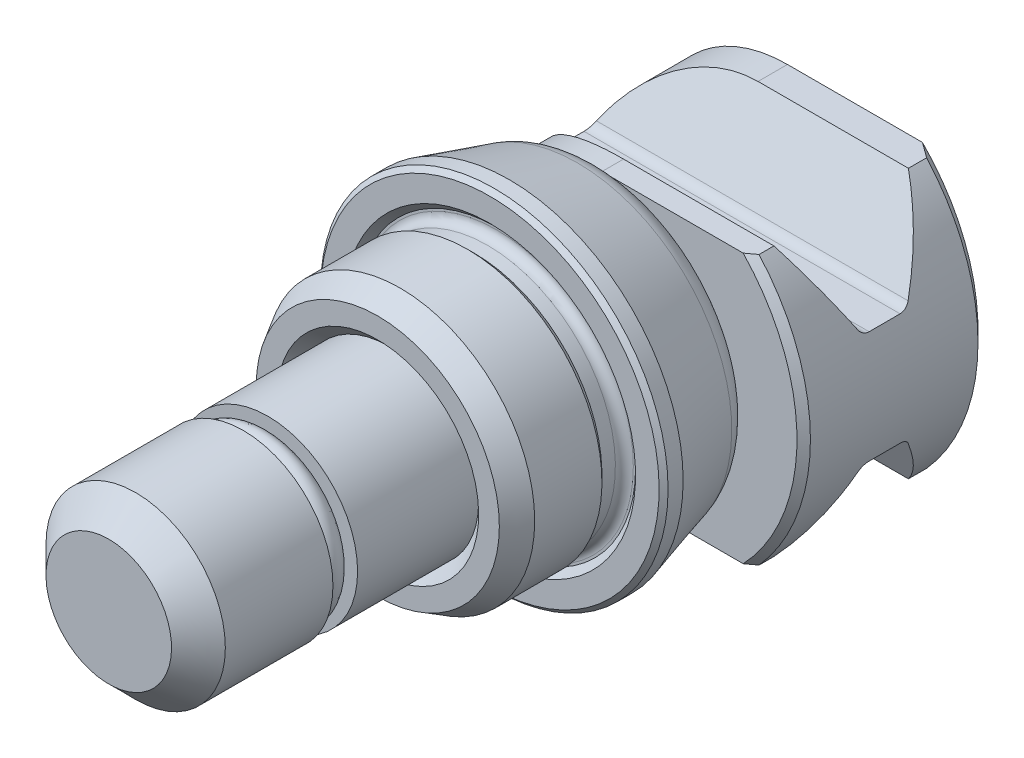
ISO-10303-21;
HEADER;
FILE_DESCRIPTION(('STEP AP214'),'2;1');
FILE_NAME('part.step','',(''),(''),'','','');
FILE_SCHEMA(('AUTOMOTIVE_DESIGN { 1 0 10303 214 1 1 1 1 }'));
ENDSEC;
DATA;
#1=APPLICATION_CONTEXT('core data for automotive mechanical design processes');
#2=APPLICATION_PROTOCOL_DEFINITION('international standard','automotive_design',2000,#1);
#3=PRODUCT_CONTEXT('',#1,'mechanical');
#4=PRODUCT('Part','Part','',(#3));
#5=PRODUCT_RELATED_PRODUCT_CATEGORY('part','',(#4));
#6=PRODUCT_DEFINITION_FORMATION('','',#4);
#7=PRODUCT_DEFINITION_CONTEXT('part definition',#1,'design');
#8=PRODUCT_DEFINITION('design','',#6,#7);
#9=PRODUCT_DEFINITION_SHAPE('','',#8);
#10=(LENGTH_UNIT() NAMED_UNIT(*) SI_UNIT(.MILLI.,.METRE.));
#11=(NAMED_UNIT(*) PLANE_ANGLE_UNIT() SI_UNIT($,.RADIAN.));
#12=(NAMED_UNIT(*) SI_UNIT($,.STERADIAN.) SOLID_ANGLE_UNIT());
#13=UNCERTAINTY_MEASURE_WITH_UNIT(LENGTH_MEASURE(1.E-05),#10,'distance_accuracy_value','');
#14=(GEOMETRIC_REPRESENTATION_CONTEXT(3) GLOBAL_UNCERTAINTY_ASSIGNED_CONTEXT((#13)) GLOBAL_UNIT_ASSIGNED_CONTEXT((#10,
#11,#12)) REPRESENTATION_CONTEXT('',''));
#15=CARTESIAN_POINT('',(0.,0.,0.));
#16=DIRECTION('',(0.,0.,1.));
#17=DIRECTION('',(1.,0.,0.));
#18=AXIS2_PLACEMENT_3D('',#15,#16,#17);
#19=CARTESIAN_POINT('',(3.2,0.,10.4));
#20=DIRECTION('',(0.,-1.,0.));
#21=DIRECTION('',(1.,0.,0.));
#22=AXIS2_PLACEMENT_3D('',#19,#20,#21);
#23=ELLIPSE('',#22,0.5,0.5);
#24=CARTESIAN_POINT('',(0.,0.,10.4));
#25=DIRECTION('',(0.,0.,-1.));
#26=AXIS1_PLACEMENT('',#24,#25);
#27=SURFACE_OF_REVOLUTION('',#23,#26);
#28=CARTESIAN_POINT('',(0.,0.,9.9));
#29=DIRECTION('',(0.,0.,-1.));
#30=DIRECTION('',(0.,1.,0.));
#31=AXIS2_PLACEMENT_3D('',#28,#29,#30);
#32=CIRCLE('',#31,3.2);
#33=CARTESIAN_POINT('',(0.,3.2,9.9));
#34=VERTEX_POINT('',#33);
#35=EDGE_CURVE('E9',#34,#34,#32,.T.);
#36=ORIENTED_EDGE('',*,*,#35,.F.);
#37=EDGE_LOOP('',(#36));
#38=FACE_BOUND('',#37,.T.);
#39=CARTESIAN_POINT('',(0.,0.,10.9));
#40=DIRECTION('',(0.,0.,1.));
#41=DIRECTION('',(0.,-1.,0.));
#42=AXIS2_PLACEMENT_3D('',#39,#40,#41);
#43=CIRCLE('',#42,3.2);
#44=CARTESIAN_POINT('',(0.,-3.2,10.9));
#45=VERTEX_POINT('',#44);
#46=EDGE_CURVE('E23',#45,#45,#43,.T.);
#47=ORIENTED_EDGE('',*,*,#46,.F.);
#48=EDGE_LOOP('',(#47));
#49=FACE_BOUND('',#48,.T.);
#50=ADVANCED_FACE('F14',(#38,#49),#27,.F.);
#51=CARTESIAN_POINT('',(0.,0.,10.9));
#52=DIRECTION('',(0.,0.,1.));
#53=DIRECTION('',(0.,-1.,0.));
#54=AXIS2_PLACEMENT_3D('',#51,#52,#53);
#55=PLANE('',#54);
#56=CARTESIAN_POINT('',(0.,0.,10.9));
#57=DIRECTION('',(0.,0.,1.));
#58=DIRECTION('',(0.,-1.,0.));
#59=AXIS2_PLACEMENT_3D('',#56,#57,#58);
#60=CIRCLE('',#59,2.7);
#61=CARTESIAN_POINT('',(0.,-2.7,10.9));
#62=VERTEX_POINT('',#61);
#63=EDGE_CURVE('E18',#62,#62,#60,.F.);
#64=ORIENTED_EDGE('',*,*,#63,.T.);
#65=EDGE_LOOP('',(#64));
#66=FACE_BOUND('',#65,.T.);
#67=ORIENTED_EDGE('',*,*,#46,.T.);
#68=EDGE_LOOP('',(#67));
#69=FACE_BOUND('',#68,.T.);
#70=ADVANCED_FACE('F539',(#66,#69),#55,.T.);
#71=CARTESIAN_POINT('',(0.,0.,17.));
#72=DIRECTION('',(0.,0.,1.));
#73=DIRECTION('',(0.,1.,0.));
#74=AXIS2_PLACEMENT_3D('',#71,#72,#73);
#75=PLANE('',#74);
#76=CARTESIAN_POINT('',(0.,0.,17.));
#77=DIRECTION('',(0.,0.,1.));
#78=DIRECTION('',(0.,1.,0.));
#79=AXIS2_PLACEMENT_3D('',#76,#77,#78);
#80=CIRCLE('',#79,2.8);
#81=CARTESIAN_POINT('',(0.,2.8,17.));
#82=VERTEX_POINT('',#81);
#83=EDGE_CURVE('E305',#82,#82,#80,.T.);
#84=ORIENTED_EDGE('',*,*,#83,.T.);
#85=EDGE_LOOP('',(#84));
#86=FACE_BOUND('',#85,.T.);
#87=ADVANCED_FACE('F560',(#86),#75,.T.);
#88=CARTESIAN_POINT('',(0.,0.,15.8));
#89=DIRECTION('',(0.,0.,-1.));
#90=DIRECTION('',(0.,-1.,0.));
#91=AXIS2_PLACEMENT_3D('',#88,#89,#90);
#92=CONICAL_SURFACE('',#91,4.,0.785398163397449);
#93=ORIENTED_EDGE('',*,*,#83,.F.);
#94=EDGE_LOOP('',(#93));
#95=FACE_BOUND('',#94,.T.);
#96=CARTESIAN_POINT('',(0.,0.,15.8));
#97=DIRECTION('',(0.,0.,1.));
#98=DIRECTION('',(0.,1.,0.));
#99=AXIS2_PLACEMENT_3D('',#96,#97,#98);
#100=CIRCLE('',#99,4.);
#101=CARTESIAN_POINT('',(0.,4.,15.8));
#102=VERTEX_POINT('',#101);
#103=EDGE_CURVE('E302',#102,#102,#100,.F.);
#104=ORIENTED_EDGE('',*,*,#103,.F.);
#105=EDGE_LOOP('',(#104));
#106=FACE_BOUND('',#105,.T.);
#107=ADVANCED_FACE('F380',(#95,#106),#92,.T.);
#108=CARTESIAN_POINT('',(0.,0.,-5.));
#109=DIRECTION('',(0.,0.,-1.));
#110=DIRECTION('',(0.,-1.,0.));
#111=AXIS2_PLACEMENT_3D('',#108,#109,#110);
#112=CYLINDRICAL_SURFACE('',#111,4.);
#113=CARTESIAN_POINT('',(0.,0.,11.));
#114=DIRECTION('',(0.,0.,-1.));
#115=DIRECTION('',(0.,-1.,0.));
#116=AXIS2_PLACEMENT_3D('',#113,#114,#115);
#117=CIRCLE('',#116,4.);
#118=CARTESIAN_POINT('',(0.,-4.,11.));
#119=VERTEX_POINT('',#118);
#120=EDGE_CURVE('E249',#119,#119,#117,.T.);
#121=ORIENTED_EDGE('',*,*,#120,.F.);
#122=EDGE_LOOP('',(#121));
#123=FACE_BOUND('',#122,.T.);
#124=ORIENTED_EDGE('',*,*,#103,.T.);
#125=EDGE_LOOP('',(#124));
#126=FACE_BOUND('',#125,.T.);
#127=ADVANCED_FACE('F551',(#123,#126),#112,.T.);
#128=CARTESIAN_POINT('',(-2.7,0.,11.));
#129=DIRECTION('',(0.,0.,1.));
#130=DIRECTION('',(0.,1.,0.));
#131=AXIS2_PLACEMENT_3D('',#128,#129,#130);
#132=PLANE('',#131);
#133=CARTESIAN_POINT('',(0.,0.,11.));
#134=DIRECTION('',(0.,0.,-1.));
#135=DIRECTION('',(0.,-1.,0.));
#136=AXIS2_PLACEMENT_3D('',#133,#134,#135);
#137=CIRCLE('',#136,2.7);
#138=CARTESIAN_POINT('',(0.,-2.7,11.));
#139=VERTEX_POINT('',#138);
#140=EDGE_CURVE('E237',#139,#139,#137,.T.);
#141=ORIENTED_EDGE('',*,*,#140,.F.);
#142=EDGE_LOOP('',(#141));
#143=FACE_BOUND('',#142,.T.);
#144=ORIENTED_EDGE('',*,*,#120,.T.);
#145=EDGE_LOOP('',(#144));
#146=FACE_BOUND('',#145,.T.);
#147=ADVANCED_FACE('F545',(#143,#146),#132,.F.);
#148=CARTESIAN_POINT('',(0.,0.,-5.));
#149=DIRECTION('',(0.,0.,-1.));
#150=DIRECTION('',(0.,-1.,0.));
#151=AXIS2_PLACEMENT_3D('',#148,#149,#150);
#152=CYLINDRICAL_SURFACE('',#151,2.7);
#153=ORIENTED_EDGE('',*,*,#63,.F.);
#154=EDGE_LOOP('',(#153));
#155=FACE_BOUND('',#154,.T.);
#156=ORIENTED_EDGE('',*,*,#140,.T.);
#157=EDGE_LOOP('',(#156));
#158=FACE_BOUND('',#157,.T.);
#159=ADVANCED_FACE('F541',(#155,#158),#152,.T.);
#160=CARTESIAN_POINT('',(0.,0.,0.));
#161=DIRECTION('',(0.,0.,-1.));
#162=DIRECTION('',(0.,1.,0.));
#163=AXIS2_PLACEMENT_3D('',#160,#161,#162);
#164=CYLINDRICAL_SURFACE('',#163,6.);
#165=CARTESIAN_POINT('',(0.,0.,1.));
#166=DIRECTION('',(0.,0.,-1.));
#167=DIRECTION('',(0.,1.,0.));
#168=AXIS2_PLACEMENT_3D('',#165,#166,#167);
#169=CIRCLE('',#168,6.);
#170=CARTESIAN_POINT('',(0.,6.,1.));
#171=VERTEX_POINT('',#170);
#172=EDGE_CURVE('E493',#171,#171,#169,.T.);
#173=ORIENTED_EDGE('',*,*,#172,.F.);
#174=EDGE_LOOP('',(#173));
#175=FACE_BOUND('',#174,.T.);
#176=CARTESIAN_POINT('',(0.,0.,4.));
#177=DIRECTION('',(0.,0.,1.));
#178=DIRECTION('',(0.,-1.,0.));
#179=AXIS2_PLACEMENT_3D('',#176,#177,#178);
#180=CIRCLE('',#179,6.);
#181=CARTESIAN_POINT('',(0.,-6.,4.));
#182=VERTEX_POINT('',#181);
#183=EDGE_CURVE('E508',#182,#182,#180,.F.);
#184=ORIENTED_EDGE('',*,*,#183,.T.);
#185=EDGE_LOOP('',(#184));
#186=FACE_BOUND('',#185,.T.);
#187=ADVANCED_FACE('F544',(#175,#186),#164,.T.);
#188=CARTESIAN_POINT('',(6.,0.,0.));
#189=DIRECTION('',(0.,0.,1.));
#190=DIRECTION('',(0.,-1.,0.));
#191=AXIS2_PLACEMENT_3D('',#188,#189,#190);
#192=PLANE('',#191);
#193=CARTESIAN_POINT('',(0.,0.,0.));
#194=DIRECTION('',(0.,0.,-1.));
#195=DIRECTION('',(0.,1.,0.));
#196=AXIS2_PLACEMENT_3D('',#193,#194,#195);
#197=CIRCLE('',#196,6.5);
#198=CARTESIAN_POINT('',(0.,6.5,0.));
#199=VERTEX_POINT('',#198);
#200=EDGE_CURVE('E496',#199,#199,#197,.T.);
#201=ORIENTED_EDGE('',*,*,#200,.T.);
#202=EDGE_LOOP('',(#201));
#203=FACE_BOUND('',#202,.T.);
#204=CARTESIAN_POINT('',(0.,0.,0.));
#205=DIRECTION('',(0.,0.,1.));
#206=DIRECTION('',(0.,-1.,0.));
#207=AXIS2_PLACEMENT_3D('',#204,#205,#206);
#208=CIRCLE('',#207,7.55);
#209=CARTESIAN_POINT('',(0.,-7.55,0.));
#210=VERTEX_POINT('',#209);
#211=EDGE_CURVE('E523',#210,#210,#208,.T.);
#212=ORIENTED_EDGE('',*,*,#211,.T.);
#213=EDGE_LOOP('',(#212));
#214=FACE_BOUND('',#213,.T.);
#215=ADVANCED_FACE('F613',(#203,#214),#192,.T.);
#216=CARTESIAN_POINT('',(0.,0.,0.));
#217=DIRECTION('',(0.,0.,-1.));
#218=DIRECTION('',(0.,1.,0.));
#219=AXIS2_PLACEMENT_3D('',#216,#217,#218);
#220=CYLINDRICAL_SURFACE('',#219,7.75);
#221=CARTESIAN_POINT('',(0.,0.,-0.2));
#222=DIRECTION('',(0.,0.,1.));
#223=DIRECTION('',(0.,-1.,0.));
#224=AXIS2_PLACEMENT_3D('',#221,#222,#223);
#225=CIRCLE('',#224,7.75);
#226=CARTESIAN_POINT('',(0.,-7.75,-0.2));
#227=VERTEX_POINT('',#226);
#228=EDGE_CURVE('E520',#227,#227,#225,.F.);
#229=ORIENTED_EDGE('',*,*,#228,.T.);
#230=EDGE_LOOP('',(#229));
#231=FACE_BOUND('',#230,.T.);
#232=CARTESIAN_POINT('',(0.,0.,-0.871853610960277));
#233=DIRECTION('',(0.,0.,-1.));
#234=DIRECTION('',(0.,1.,0.));
#235=AXIS2_PLACEMENT_3D('',#232,#233,#234);
#236=CIRCLE('',#235,7.75);
#237=CARTESIAN_POINT('',(0.,7.75,-0.871853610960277));
#238=VERTEX_POINT('',#237);
#239=EDGE_CURVE('E499',#238,#238,#236,.T.);
#240=ORIENTED_EDGE('',*,*,#239,.F.);
#241=EDGE_LOOP('',(#240));
#242=FACE_BOUND('',#241,.T.);
#243=ADVANCED_FACE('F619',(#231,#242),#220,.T.);
#244=CARTESIAN_POINT('',(0.,0.,-5.));
#245=DIRECTION('',(0.,0.,1.));
#246=DIRECTION('',(0.,-1.,0.));
#247=AXIS2_PLACEMENT_3D('',#244,#245,#246);
#248=CONICAL_SURFACE('',#247,6.56627307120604,0.279252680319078);
#249=CARTESIAN_POINT('',(0.,0.,-3.91345603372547));
#250=DIRECTION('',(0.,0.,-1.));
#251=DIRECTION('',(0.,1.,0.));
#252=AXIS2_PLACEMENT_3D('',#249,#250,#251);
#253=CIRCLE('',#252,6.87783453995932);
#254=CARTESIAN_POINT('',(0.,6.87783453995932,-3.91345603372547));
#255=VERTEX_POINT('',#254);
#256=EDGE_CURVE('E505',#255,#255,#253,.F.);
#257=ORIENTED_EDGE('',*,*,#256,.T.);
#258=EDGE_LOOP('',(#257));
#259=FACE_BOUND('',#258,.T.);
#260=ORIENTED_EDGE('',*,*,#239,.T.);
#261=EDGE_LOOP('',(#260));
#262=FACE_BOUND('',#261,.T.);
#263=ADVANCED_FACE('F603',(#259,#262),#248,.T.);
#264=CARTESIAN_POINT('',(4.,0.,5.));
#265=DIRECTION('',(0.,0.,1.));
#266=DIRECTION('',(0.,-1.,0.));
#267=AXIS2_PLACEMENT_3D('',#264,#265,#266);
#268=PLANE('',#267);
#269=CARTESIAN_POINT('',(0.,0.,5.));
#270=DIRECTION('',(0.,0.,1.));
#271=DIRECTION('',(0.,-1.,0.));
#272=AXIS2_PLACEMENT_3D('',#269,#270,#271);
#273=CIRCLE('',#272,4.5);
#274=CARTESIAN_POINT('',(0.,-4.5,5.));
#275=VERTEX_POINT('',#274);
#276=EDGE_CURVE('E514',#275,#275,#273,.F.);
#277=ORIENTED_EDGE('',*,*,#276,.T.);
#278=EDGE_LOOP('',(#277));
#279=FACE_BOUND('',#278,.T.);
#280=CARTESIAN_POINT('',(0.,0.,5.));
#281=DIRECTION('',(0.,0.,1.));
#282=DIRECTION('',(0.,-1.,0.));
#283=AXIS2_PLACEMENT_3D('',#280,#281,#282);
#284=CIRCLE('',#283,5.42264973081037);
#285=CARTESIAN_POINT('',(0.,-5.42264973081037,5.));
#286=VERTEX_POINT('',#285);
#287=EDGE_CURVE('E511',#286,#286,#284,.T.);
#288=ORIENTED_EDGE('',*,*,#287,.T.);
#289=EDGE_LOOP('',(#288));
#290=FACE_BOUND('',#289,.T.);
#291=ADVANCED_FACE('F599',(#279,#290),#268,.T.);
#292=CARTESIAN_POINT('',(0.,0.,-3.5));
#293=DIRECTION('',(0.,0.,-1.));
#294=DIRECTION('',(0.,1.,0.));
#295=AXIS2_PLACEMENT_3D('',#292,#293,#294);
#296=TOROIDAL_SURFACE('',#295,5.43594199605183,1.5);
#297=ORIENTED_EDGE('',*,*,#256,.F.);
#298=EDGE_LOOP('',(#297));
#299=FACE_BOUND('',#298,.T.);
#300=CARTESIAN_POINT('',(0.,0.,-5.));
#301=DIRECTION('',(0.,0.,-1.));
#302=DIRECTION('',(0.,1.,0.));
#303=AXIS2_PLACEMENT_3D('',#300,#301,#302);
#304=CIRCLE('',#303,5.43594199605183);
#305=CARTESIAN_POINT('',(0.,5.43594199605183,-5.));
#306=VERTEX_POINT('',#305);
#307=EDGE_CURVE('E502',#306,#306,#304,.T.);
#308=ORIENTED_EDGE('',*,*,#307,.F.);
#309=EDGE_LOOP('',(#308));
#310=FACE_BOUND('',#309,.T.);
#311=ADVANCED_FACE('F602',(#299,#310),#296,.T.);
#312=CARTESIAN_POINT('',(0.,0.,4.));
#313=DIRECTION('',(0.,0.,-1.));
#314=DIRECTION('',(0.,1.,0.));
#315=AXIS2_PLACEMENT_3D('',#312,#313,#314);
#316=CONICAL_SURFACE('',#315,6.,0.523598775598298);
#317=ORIENTED_EDGE('',*,*,#287,.F.);
#318=EDGE_LOOP('',(#317));
#319=FACE_BOUND('',#318,.T.);
#320=ORIENTED_EDGE('',*,*,#183,.F.);
#321=EDGE_LOOP('',(#320));
#322=FACE_BOUND('',#321,.T.);
#323=ADVANCED_FACE('F595',(#319,#322),#316,.T.);
#324=CARTESIAN_POINT('',(0.,0.,5.));
#325=DIRECTION('',(0.,0.,1.));
#326=DIRECTION('',(0.,-1.,0.));
#327=AXIS2_PLACEMENT_3D('',#324,#325,#326);
#328=CONICAL_SURFACE('',#327,4.5,0.785398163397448);
#329=CARTESIAN_POINT('',(0.,0.,4.5));
#330=DIRECTION('',(0.,0.,1.));
#331=DIRECTION('',(0.,-1.,0.));
#332=AXIS2_PLACEMENT_3D('',#329,#330,#331);
#333=CIRCLE('',#332,4.);
#334=CARTESIAN_POINT('',(0.,-4.,4.5));
#335=VERTEX_POINT('',#334);
#336=EDGE_CURVE('E517',#335,#335,#333,.T.);
#337=ORIENTED_EDGE('',*,*,#336,.F.);
#338=EDGE_LOOP('',(#337));
#339=FACE_BOUND('',#338,.T.);
#340=ORIENTED_EDGE('',*,*,#276,.F.);
#341=EDGE_LOOP('',(#340));
#342=FACE_BOUND('',#341,.T.);
#343=ADVANCED_FACE('F591',(#339,#342),#328,.F.);
#344=CARTESIAN_POINT('',(0.,0.,-0.2));
#345=DIRECTION('',(0.,0.,-1.));
#346=DIRECTION('',(0.,1.,0.));
#347=AXIS2_PLACEMENT_3D('',#344,#345,#346);
#348=CONICAL_SURFACE('',#347,7.75,0.78539816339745);
#349=ORIENTED_EDGE('',*,*,#211,.F.);
#350=EDGE_LOOP('',(#349));
#351=FACE_BOUND('',#350,.T.);
#352=ORIENTED_EDGE('',*,*,#228,.F.);
#353=EDGE_LOOP('',(#352));
#354=FACE_BOUND('',#353,.T.);
#355=ADVANCED_FACE('F594',(#351,#354),#348,.T.);
#356=CARTESIAN_POINT('',(0.,0.,-0.3));
#357=DIRECTION('',(0.,0.,1.));
#358=DIRECTION('',(0.,-1.,0.));
#359=AXIS2_PLACEMENT_3D('',#356,#357,#358);
#360=CONICAL_SURFACE('',#359,6.2,0.785398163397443);
#361=ORIENTED_EDGE('',*,*,#200,.F.);
#362=EDGE_LOOP('',(#361));
#363=FACE_BOUND('',#362,.T.);
#364=CARTESIAN_POINT('',(0.,0.,-0.3));
#365=DIRECTION('',(0.,0.,-1.));
#366=DIRECTION('',(0.,1.,0.));
#367=AXIS2_PLACEMENT_3D('',#364,#365,#366);
#368=CIRCLE('',#367,6.2);
#369=CARTESIAN_POINT('',(0.,6.2,-0.3));
#370=VERTEX_POINT('',#369);
#371=EDGE_CURVE('E487',#370,#370,#368,.T.);
#372=ORIENTED_EDGE('',*,*,#371,.T.);
#373=EDGE_LOOP('',(#372));
#374=FACE_BOUND('',#373,.T.);
#375=ADVANCED_FACE('F630',(#363,#374),#360,.F.);
#376=CARTESIAN_POINT('',(0.,0.,1.));
#377=DIRECTION('',(0.,0.,1.));
#378=DIRECTION('',(0.,-1.,0.));
#379=AXIS2_PLACEMENT_3D('',#376,#377,#378);
#380=CONICAL_SURFACE('',#379,6.,0.785398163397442);
#381=CARTESIAN_POINT('',(0.,0.,0.7));
#382=DIRECTION('',(0.,0.,-1.));
#383=DIRECTION('',(0.,1.,0.));
#384=AXIS2_PLACEMENT_3D('',#381,#382,#383);
#385=CIRCLE('',#384,5.7);
#386=CARTESIAN_POINT('',(0.,5.7,0.7));
#387=VERTEX_POINT('',#386);
#388=EDGE_CURVE('E490',#387,#387,#385,.T.);
#389=ORIENTED_EDGE('',*,*,#388,.F.);
#390=EDGE_LOOP('',(#389));
#391=FACE_BOUND('',#390,.T.);
#392=ORIENTED_EDGE('',*,*,#172,.T.);
#393=EDGE_LOOP('',(#392));
#394=FACE_BOUND('',#393,.T.);
#395=ADVANCED_FACE('F647',(#391,#394),#380,.T.);
#396=CARTESIAN_POINT('',(0.,0.,0.));
#397=DIRECTION('',(0.,0.,-1.));
#398=DIRECTION('',(0.,1.,0.));
#399=AXIS2_PLACEMENT_3D('',#396,#397,#398);
#400=CYLINDRICAL_SURFACE('',#399,5.7);
#401=CARTESIAN_POINT('',(0.,0.,0.1));
#402=DIRECTION('',(0.,0.,-1.));
#403=DIRECTION('',(0.,1.,0.));
#404=AXIS2_PLACEMENT_3D('',#401,#402,#403);
#405=CIRCLE('',#404,5.7);
#406=CARTESIAN_POINT('',(0.,5.7,0.1));
#407=VERTEX_POINT('',#406);
#408=EDGE_CURVE('E529',#407,#407,#405,.F.);
#409=ORIENTED_EDGE('',*,*,#408,.T.);
#410=EDGE_LOOP('',(#409));
#411=FACE_BOUND('',#410,.T.);
#412=ORIENTED_EDGE('',*,*,#388,.T.);
#413=EDGE_LOOP('',(#412));
#414=FACE_BOUND('',#413,.T.);
#415=ADVANCED_FACE('F638',(#411,#414),#400,.T.);
#416=CARTESIAN_POINT('',(6.2,0.,-0.3));
#417=DIRECTION('',(0.,0.,-1.));
#418=DIRECTION('',(0.,1.,0.));
#419=AXIS2_PLACEMENT_3D('',#416,#417,#418);
#420=PLANE('',#419);
#421=CARTESIAN_POINT('',(0.,0.,-0.3));
#422=DIRECTION('',(0.,0.,-1.));
#423=DIRECTION('',(0.,1.,0.));
#424=AXIS2_PLACEMENT_3D('',#421,#422,#423);
#425=CIRCLE('',#424,6.1);
#426=CARTESIAN_POINT('',(0.,6.1,-0.3));
#427=VERTEX_POINT('',#426);
#428=EDGE_CURVE('E526',#427,#427,#425,.T.);
#429=ORIENTED_EDGE('',*,*,#428,.T.);
#430=EDGE_LOOP('',(#429));
#431=FACE_BOUND('',#430,.T.);
#432=ORIENTED_EDGE('',*,*,#371,.F.);
#433=EDGE_LOOP('',(#432));
#434=FACE_BOUND('',#433,.T.);
#435=ADVANCED_FACE('F633',(#431,#434),#420,.F.);
#436=CARTESIAN_POINT('',(0.,0.,0.1));
#437=DIRECTION('',(0.,0.,-1.));
#438=DIRECTION('',(0.,1.,0.));
#439=AXIS2_PLACEMENT_3D('',#436,#437,#438);
#440=TOROIDAL_SURFACE('',#439,6.1,0.4);
#441=ORIENTED_EDGE('',*,*,#408,.F.);
#442=EDGE_LOOP('',(#441));
#443=FACE_BOUND('',#442,.T.);
#444=ORIENTED_EDGE('',*,*,#428,.F.);
#445=EDGE_LOOP('',(#444));
#446=FACE_BOUND('',#445,.T.);
#447=ADVANCED_FACE('F579',(#443,#446),#440,.F.);
#448=CARTESIAN_POINT('',(-2.7,0.,9.9));
#449=DIRECTION('',(0.,0.,-1.));
#450=DIRECTION('',(0.,-1.,0.));
#451=AXIS2_PLACEMENT_3D('',#448,#449,#450);
#452=PLANE('',#451);
#453=ORIENTED_EDGE('',*,*,#35,.T.);
#454=EDGE_LOOP('',(#453));
#455=FACE_BOUND('',#454,.T.);
#456=CARTESIAN_POINT('',(0.,0.,9.9));
#457=DIRECTION('',(0.,0.,-1.));
#458=DIRECTION('',(0.,-1.,0.));
#459=AXIS2_PLACEMENT_3D('',#456,#457,#458);
#460=CIRCLE('',#459,4.);
#461=CARTESIAN_POINT('',(0.,-4.,9.9));
#462=VERTEX_POINT('',#461);
#463=EDGE_CURVE('E252',#462,#462,#460,.T.);
#464=ORIENTED_EDGE('',*,*,#463,.F.);
#465=EDGE_LOOP('',(#464));
#466=FACE_BOUND('',#465,.T.);
#467=ADVANCED_FACE('F576',(#455,#466),#452,.F.);
#468=ORIENTED_EDGE('',*,*,#336,.T.);
#469=EDGE_LOOP('',(#468));
#470=FACE_BOUND('',#469,.T.);
#471=ORIENTED_EDGE('',*,*,#463,.T.);
#472=EDGE_LOOP('',(#471));
#473=FACE_BOUND('',#472,.T.);
#474=ADVANCED_FACE('F418',(#470,#473),#112,.T.);
#475=CARTESIAN_POINT('',(0.,0.,-25.2));
#476=DIRECTION('',(0.,0.,1.));
#477=DIRECTION('',(0.,1.,0.));
#478=AXIS2_PLACEMENT_3D('',#475,#476,#477);
#479=CYLINDRICAL_SURFACE('',#478,6.);
#480=CARTESIAN_POINT('',(0.,0.,-8.49861162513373));
#481=DIRECTION('',(0.,0.5,0.86602540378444));
#482=DIRECTION('',(0.,-0.866025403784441,0.5));
#483=AXIS2_PLACEMENT_3D('',#480,#481,#482);
#484=ELLIPSE('',#483,6.9282032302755,6.);
#485=CARTESIAN_POINT('',(0.,6.,-11.9627132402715));
#486=VERTEX_POINT('',#485);
#487=CARTESIAN_POINT('',(-5.33268225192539,2.75,-10.0863248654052));
#488=VERTEX_POINT('',#487);
#489=EDGE_CURVE('E267',#486,#488,#484,.T.);
#490=ORIENTED_EDGE('',*,*,#489,.F.);
#491=DIRECTION('',(0.,0.,1.));
#492=VECTOR('',#491,1.);
#493=CARTESIAN_POINT('',(0.,6.,-25.2));
#494=LINE('',#493,#492);
#495=CARTESIAN_POINT('',(0.,6.,-13.275));
#496=VERTEX_POINT('',#495);
#497=EDGE_CURVE('E292',#496,#486,#494,.T.);
#498=ORIENTED_EDGE('',*,*,#497,.F.);
#499=CARTESIAN_POINT('',(0.,0.,-13.275));
#500=DIRECTION('',(0.,0.,1.));
#501=DIRECTION('',(0.,1.,0.));
#502=AXIS2_PLACEMENT_3D('',#499,#500,#501);
#503=CIRCLE('',#502,6.);
#504=CARTESIAN_POINT('',(0.,-6.,-13.275));
#505=VERTEX_POINT('',#504);
#506=EDGE_CURVE('E313',#496,#505,#503,.T.);
#507=ORIENTED_EDGE('',*,*,#506,.T.);
#508=DIRECTION('',(0.,0.,1.));
#509=VECTOR('',#508,1.);
#510=CARTESIAN_POINT('',(0.,-6.,-25.2));
#511=LINE('',#510,#509);
#512=CARTESIAN_POINT('',(0.,-6.,-11.9627132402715));
#513=VERTEX_POINT('',#512);
#514=EDGE_CURVE('E293',#505,#513,#511,.T.);
#515=ORIENTED_EDGE('',*,*,#514,.T.);
#516=CARTESIAN_POINT('',(0.,0.,-8.49861162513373));
#517=DIRECTION('',(0.,0.5,-0.86602540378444));
#518=DIRECTION('',(0.,0.866025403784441,0.5));
#519=AXIS2_PLACEMENT_3D('',#516,#517,#518);
#520=ELLIPSE('',#519,6.9282032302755,6.);
#521=CARTESIAN_POINT('',(-5.33268225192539,-2.75,-10.0863248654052));
#522=VERTEX_POINT('',#521);
#523=EDGE_CURVE('E276',#513,#522,#520,.T.);
#524=ORIENTED_EDGE('',*,*,#523,.T.);
#525=CARTESIAN_POINT('',(-5.33268225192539,-2.75,-10.0863248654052));
#526=CARTESIAN_POINT('',(-5.34475324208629,-2.7266029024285,-10.0728451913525));
#527=CARTESIAN_POINT('',(-5.35618869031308,-2.70403892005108,-10.0572626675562));
#528=CARTESIAN_POINT('',(-5.37755487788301,-2.66128948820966,-10.022143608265));
#529=CARTESIAN_POINT('',(-5.38748089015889,-2.64111155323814,-10.002595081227));
#530=CARTESIAN_POINT('',(-5.40554463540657,-2.60394326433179,-9.95981715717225));
#531=CARTESIAN_POINT('',(-5.4136768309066,-2.58696280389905,-9.93657673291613));
#532=CARTESIAN_POINT('',(-5.42786315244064,-2.55706390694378,-9.88706764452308));
#533=CARTESIAN_POINT('',(-5.43391962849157,-2.544140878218,-9.8608024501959));
#534=CARTESIAN_POINT('',(-5.443411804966,-2.52376416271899,-9.80804187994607));
#535=CARTESIAN_POINT('',(-5.44700580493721,-2.51598161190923,-9.78170154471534));
#536=CARTESIAN_POINT('',(-5.45213658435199,-2.504844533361,-9.72794637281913));
#537=CARTESIAN_POINT('',(-5.45367835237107,-2.50147926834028,-9.70053430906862));
#538=CARTESIAN_POINT('',(-5.45429677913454,-2.50012911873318,-9.66647580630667));
#539=CARTESIAN_POINT('',(-5.45435646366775,-2.49999877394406,-9.65989246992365));
#540=CARTESIAN_POINT('',(-5.45435605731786,-2.5,-9.65331216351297));
#541=B_SPLINE_CURVE_WITH_KNOTS('',3,(#525,#526,#527,#528,#529,#530,#531,#532,#533,#534,#535,
#536,#537,#538,#539,#540),.UNSPECIFIED.,.F.,.F.,(4,2,2,2,2,2,2,4),(0.,0.0887050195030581,
0.17768235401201,0.266930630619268,0.35607752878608,0.438754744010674,0.521230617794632,
0.540978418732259),.UNSPECIFIED.);
#542=CARTESIAN_POINT('',(-5.45435605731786,-2.5,-9.65331216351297));
#543=VERTEX_POINT('',#542);
#544=EDGE_CURVE('E353',#522,#543,#541,.T.);
#545=ORIENTED_EDGE('',*,*,#544,.T.);
#546=DIRECTION('',(0.,0.,1.));
#547=VECTOR('',#546,1.);
#548=CARTESIAN_POINT('',(-5.45435605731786,-2.5,-25.2));
#549=LINE('',#548,#547);
#550=CARTESIAN_POINT('',(-5.45435605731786,-2.5,-8.27211431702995));
#551=VERTEX_POINT('',#550);
#552=EDGE_CURVE('E283',#543,#551,#549,.T.);
#553=ORIENTED_EDGE('',*,*,#552,.T.);
#554=CARTESIAN_POINT('',(-5.45435605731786,-2.5,-8.27211431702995));
#555=CARTESIAN_POINT('',(-5.45436490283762,-2.4999688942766,-8.2459340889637));
#556=CARTESIAN_POINT('',(-5.45341453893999,-2.50205408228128,-8.21977283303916));
#557=CARTESIAN_POINT('',(-5.44966589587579,-2.51021455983,-8.16829299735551));
#558=CARTESIAN_POINT('',(-5.44687308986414,-2.5162780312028,-8.14297215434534));
#559=CARTESIAN_POINT('',(-5.43951038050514,-2.53215290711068,-8.09382141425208));
#560=CARTESIAN_POINT('',(-5.43494098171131,-2.54196324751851,-8.0699910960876));
#561=CARTESIAN_POINT('',(-5.4241421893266,-2.56492550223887,-8.02440168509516));
#562=CARTESIAN_POINT('',(-5.41791194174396,-2.57807913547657,-8.00264366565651));
#563=CARTESIAN_POINT('',(-5.4037204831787,-2.60769678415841,-7.96103367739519));
#564=CARTESIAN_POINT('',(-5.39571089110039,-2.6242520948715,-7.94126343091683));
#565=CARTESIAN_POINT('',(-5.37827561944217,-2.65980076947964,-7.9048107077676));
#566=CARTESIAN_POINT('',(-5.36885043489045,-2.67879328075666,-7.88812715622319));
#567=CARTESIAN_POINT('',(-5.35050377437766,-2.71522718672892,-7.86061048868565));
#568=CARTESIAN_POINT('',(-5.34177183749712,-2.73237833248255,-7.84926478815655));
#569=CARTESIAN_POINT('',(-5.33268225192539,-2.75,-7.83910161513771));
#570=B_SPLINE_CURVE_WITH_KNOTS('',3,(#554,#555,#556,#557,#558,#559,#560,#561,#562,#563,#564,
#565,#566,#567,#568,#569),.UNSPECIFIED.,.F.,.F.,(4,2,2,2,2,2,2,4),(0.,0.0784111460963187,
0.156590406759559,0.234747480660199,0.312944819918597,0.393607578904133,0.474242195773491,
0.54108617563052),.UNSPECIFIED.);
#571=CARTESIAN_POINT('',(-5.33268225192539,-2.75,-7.83910161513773));
#572=VERTEX_POINT('',#571);
#573=EDGE_CURVE('E391',#551,#572,#570,.T.);
#574=ORIENTED_EDGE('',*,*,#573,.T.);
#575=CARTESIAN_POINT('',(0.,0.,-9.42681485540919));
#576=DIRECTION('',(0.,0.5,0.86602540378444));
#577=DIRECTION('',(0.,-0.866025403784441,0.5));
#578=AXIS2_PLACEMENT_3D('',#575,#576,#577);
#579=ELLIPSE('',#578,6.9282032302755,6.);
#580=CARTESIAN_POINT('',(0.,-6.,-5.96271324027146));
#581=VERTEX_POINT('',#580);
#582=EDGE_CURVE('E281',#572,#581,#579,.T.);
#583=ORIENTED_EDGE('',*,*,#582,.T.);
#584=CARTESIAN_POINT('',(0.,-6.,-5.));
#585=VERTEX_POINT('',#584);
#586=EDGE_CURVE('E289',#581,#585,#511,.T.);
#587=ORIENTED_EDGE('',*,*,#586,.T.);
#588=CARTESIAN_POINT('',(0.,0.,-5.));
#589=DIRECTION('',(0.,0.,-1.));
#590=DIRECTION('',(0.,1.,0.));
#591=AXIS2_PLACEMENT_3D('',#588,#589,#590);
#592=CIRCLE('',#591,6.);
#593=CARTESIAN_POINT('',(0.,6.,-5.));
#594=VERTEX_POINT('',#593);
#595=EDGE_CURVE('E286',#585,#594,#592,.T.);
#596=ORIENTED_EDGE('',*,*,#595,.T.);
#597=CARTESIAN_POINT('',(0.,6.,-5.96271324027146));
#598=VERTEX_POINT('',#597);
#599=EDGE_CURVE('E290',#598,#594,#494,.T.);
#600=ORIENTED_EDGE('',*,*,#599,.F.);
#601=CARTESIAN_POINT('',(0.,0.,-9.42681485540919));
#602=DIRECTION('',(0.,0.5,-0.86602540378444));
#603=DIRECTION('',(0.,0.866025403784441,0.5));
#604=AXIS2_PLACEMENT_3D('',#601,#602,#603);
#605=ELLIPSE('',#604,6.9282032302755,6.);
#606=CARTESIAN_POINT('',(-5.33268225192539,2.75,-7.83910161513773));
#607=VERTEX_POINT('',#606);
#608=EDGE_CURVE('E263',#607,#598,#605,.T.);
#609=ORIENTED_EDGE('',*,*,#608,.F.);
#610=CARTESIAN_POINT('',(-5.33268225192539,2.75,-7.83910161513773));
#611=CARTESIAN_POINT('',(-5.34475324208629,2.72660290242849,-7.8525812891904));
#612=CARTESIAN_POINT('',(-5.35618869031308,2.70403892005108,-7.86816381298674));
#613=CARTESIAN_POINT('',(-5.37755487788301,2.66128948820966,-7.90328287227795));
#614=CARTESIAN_POINT('',(-5.38748089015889,2.64111155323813,-7.92283139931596));
#615=CARTESIAN_POINT('',(-5.40554463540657,2.60394326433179,-7.96560932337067));
#616=CARTESIAN_POINT('',(-5.4136768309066,2.58696280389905,-7.98884974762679));
#617=CARTESIAN_POINT('',(-5.42786315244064,2.55706390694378,-8.03835883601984));
#618=CARTESIAN_POINT('',(-5.43391962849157,2.544140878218,-8.06462403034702));
#619=CARTESIAN_POINT('',(-5.443411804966,2.52376416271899,-8.11738460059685));
#620=CARTESIAN_POINT('',(-5.44700580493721,2.51598161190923,-8.14372493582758));
#621=CARTESIAN_POINT('',(-5.45213658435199,2.504844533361,-8.19748010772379));
#622=CARTESIAN_POINT('',(-5.45367835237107,2.50147926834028,-8.22489217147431));
#623=CARTESIAN_POINT('',(-5.45429677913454,2.50012911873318,-8.25895067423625));
#624=CARTESIAN_POINT('',(-5.45435646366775,2.49999877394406,-8.26553401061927));
#625=CARTESIAN_POINT('',(-5.45435605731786,2.5,-8.27211431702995));
#626=B_SPLINE_CURVE_WITH_KNOTS('',3,(#610,#611,#612,#613,#614,#615,#616,#617,#618,#619,#620,
#621,#622,#623,#624,#625),.UNSPECIFIED.,.F.,.F.,(4,2,2,2,2,2,2,4),(0.,0.0887050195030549,
0.177682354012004,0.266930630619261,0.356077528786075,0.438754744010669,0.521230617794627,
0.540978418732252),.UNSPECIFIED.);
#627=CARTESIAN_POINT('',(-5.45435605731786,2.5,-8.27211431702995));
#628=VERTEX_POINT('',#627);
#629=EDGE_CURVE('E403',#607,#628,#626,.T.);
#630=ORIENTED_EDGE('',*,*,#629,.T.);
#631=DIRECTION('',(0.,0.,1.));
#632=VECTOR('',#631,1.);
#633=CARTESIAN_POINT('',(-5.45435605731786,2.5,-25.2));
#634=LINE('',#633,#632);
#635=CARTESIAN_POINT('',(-5.45435605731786,2.5,-9.65331216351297));
#636=VERTEX_POINT('',#635);
#637=EDGE_CURVE('E270',#636,#628,#634,.T.);
#638=ORIENTED_EDGE('',*,*,#637,.F.);
#639=CARTESIAN_POINT('',(-5.45435605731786,2.5,-9.65331216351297));
#640=CARTESIAN_POINT('',(-5.45436490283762,2.4999688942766,-9.67949239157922));
#641=CARTESIAN_POINT('',(-5.45341453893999,2.50205408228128,-9.70565364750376));
#642=CARTESIAN_POINT('',(-5.44966589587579,2.51021455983,-9.7571334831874));
#643=CARTESIAN_POINT('',(-5.44687308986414,2.5162780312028,-9.78245432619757));
#644=CARTESIAN_POINT('',(-5.43951038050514,2.53215290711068,-9.83160506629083));
#645=CARTESIAN_POINT('',(-5.43494098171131,2.54196324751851,-9.85543538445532));
#646=CARTESIAN_POINT('',(-5.4241421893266,2.56492550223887,-9.90102479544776));
#647=CARTESIAN_POINT('',(-5.41791194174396,2.57807913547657,-9.92278281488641));
#648=CARTESIAN_POINT('',(-5.4037204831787,2.60769678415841,-9.96439280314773));
#649=CARTESIAN_POINT('',(-5.39571089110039,2.6242520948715,-9.98416304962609));
#650=CARTESIAN_POINT('',(-5.37827561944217,2.65980076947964,-10.0206157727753));
#651=CARTESIAN_POINT('',(-5.36885043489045,2.67879328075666,-10.0372993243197));
#652=CARTESIAN_POINT('',(-5.35050377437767,2.71522718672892,-10.0648159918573));
#653=CARTESIAN_POINT('',(-5.34177183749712,2.73237833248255,-10.0761616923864));
#654=CARTESIAN_POINT('',(-5.33268225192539,2.75,-10.0863248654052));
#655=B_SPLINE_CURVE_WITH_KNOTS('',3,(#639,#640,#641,#642,#643,#644,#645,#646,#647,#648,#649,
#650,#651,#652,#653,#654),.UNSPECIFIED.,.F.,.F.,(4,2,2,2,2,2,2,4),(0.,0.0784111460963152,
0.15659040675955,0.234747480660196,0.312944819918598,0.393607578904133,0.474242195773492,
0.541086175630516),.UNSPECIFIED.);
#656=EDGE_CURVE('E429',#636,#488,#655,.T.);
#657=ORIENTED_EDGE('',*,*,#656,.T.);
#658=EDGE_LOOP('',(#490,#498,#507,#515,#524,#545,#553,#574,#583,#587,#596,#600,#609,#630,#638,#657));
#659=FACE_BOUND('',#658,.T.);
#660=ADVANCED_FACE('F368',(#659),#479,.T.);
#661=CARTESIAN_POINT('',(10.,6.,-25.5));
#662=DIRECTION('',(0.,-1.,0.));
#663=DIRECTION('',(0.,0.,1.));
#664=AXIS2_PLACEMENT_3D('',#661,#662,#663);
#665=PLANE('',#664);
#666=DIRECTION('',(0.,0.,-1.));
#667=VECTOR('',#666,1.);
#668=CARTESIAN_POINT('',(6.70820393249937,6.,-5.));
#669=LINE('',#668,#667);
#670=CARTESIAN_POINT('',(6.70820393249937,6.,-11.9627132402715));
#671=VERTEX_POINT('',#670);
#672=CARTESIAN_POINT('',(6.70820393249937,6.,-12.775));
#673=VERTEX_POINT('',#672);
#674=EDGE_CURVE('E299',#671,#673,#669,.T.);
#675=ORIENTED_EDGE('',*,*,#674,.T.);
#676=CARTESIAN_POINT('',(6.70820393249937,6.,-12.775));
#677=CARTESIAN_POINT('',(6.65140740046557,6.,-12.8173333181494));
#678=CARTESIAN_POINT('',(6.59449657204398,6.,-12.8595135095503));
#679=CARTESIAN_POINT('',(6.48043685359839,6.,-12.94354635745));
#680=CARTESIAN_POINT('',(6.42328797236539,6.,-12.9853990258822));
#681=CARTESIAN_POINT('',(6.3087383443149,6.,-13.0687587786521));
#682=CARTESIAN_POINT('',(6.25133759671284,6.,-13.110265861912));
#683=CARTESIAN_POINT('',(6.136269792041,6.,-13.1929136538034));
#684=CARTESIAN_POINT('',(6.0786027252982,6.,-13.2340543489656));
#685=CARTESIAN_POINT('',(6.02079728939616,6.,-13.275));
#686=B_SPLINE_CURVE_WITH_KNOTS('',3,(#676,#677,#678,#679,#680,#681,#682,#683,#684,#685),
.UNSPECIFIED.,.F.,.F.,(4,2,2,2,4),(0.,0.212512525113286,0.42501727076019,0.637522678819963,
0.850035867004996),.UNSPECIFIED.);
#687=CARTESIAN_POINT('',(6.02079728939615,6.,-13.275));
#688=VERTEX_POINT('',#687);
#689=EDGE_CURVE('E480',#673,#688,#686,.T.);
#690=ORIENTED_EDGE('',*,*,#689,.T.);
#691=DIRECTION('',(-1.,0.,0.));
#692=VECTOR('',#691,1.);
#693=CARTESIAN_POINT('',(10.,6.,-13.275));
#694=LINE('',#693,#692);
#695=EDGE_CURVE('E258',#688,#496,#694,.T.);
#696=ORIENTED_EDGE('',*,*,#695,.T.);
#697=ORIENTED_EDGE('',*,*,#497,.T.);
#698=DIRECTION('',(-1.,0.,0.));
#699=VECTOR('',#698,1.);
#700=CARTESIAN_POINT('',(15.,6.,-11.9627132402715));
#701=LINE('',#700,#699);
#702=EDGE_CURVE('E261',#671,#486,#701,.T.);
#703=ORIENTED_EDGE('',*,*,#702,.F.);
#704=EDGE_LOOP('',(#675,#690,#696,#697,#703));
#705=FACE_BOUND('',#704,.T.);
#706=ADVANCED_FACE('F472',(#705),#665,.F.);
#707=DIRECTION('',(1.,0.,0.));
#708=VECTOR('',#707,1.);
#709=CARTESIAN_POINT('',(0.,6.,-5.));
#710=LINE('',#709,#708);
#711=CARTESIAN_POINT('',(6.3,6.,-5.));
#712=VERTEX_POINT('',#711);
#713=EDGE_CURVE('E310',#594,#712,#710,.T.);
#714=ORIENTED_EDGE('',*,*,#713,.T.);
#715=CARTESIAN_POINT('',(6.3,6.,-5.));
#716=CARTESIAN_POINT('',(6.36837833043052,6.,-5.0495314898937));
#717=CARTESIAN_POINT('',(6.4365844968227,6.00000000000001,-5.099297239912));
#718=CARTESIAN_POINT('',(6.57265247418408,6.00000000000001,-5.19929724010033));
#719=CARTESIAN_POINT('',(6.64051428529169,6.,-5.24953149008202));
#720=CARTESIAN_POINT('',(6.70820393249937,6.,-5.3));
#721=B_SPLINE_CURVE_WITH_KNOTS('',3,(#715,#716,#717,#718,#719,#720),.UNSPECIFIED.,.F.,.F.,(4,2,
4),(0.,0.253295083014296,0.50659006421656),.UNSPECIFIED.);
#722=CARTESIAN_POINT('',(6.70820393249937,6.,-5.3));
#723=VERTEX_POINT('',#722);
#724=EDGE_CURVE('E463',#712,#723,#721,.T.);
#725=ORIENTED_EDGE('',*,*,#724,.T.);
#726=CARTESIAN_POINT('',(6.70820393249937,6.,-5.96271324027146));
#727=VERTEX_POINT('',#726);
#728=EDGE_CURVE('E296',#723,#727,#669,.T.);
#729=ORIENTED_EDGE('',*,*,#728,.T.);
#730=DIRECTION('',(-1.,0.,0.));
#731=VECTOR('',#730,1.);
#732=CARTESIAN_POINT('',(15.,6.,-5.96271324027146));
#733=LINE('',#732,#731);
#734=EDGE_CURVE('E260',#727,#598,#733,.T.);
#735=ORIENTED_EDGE('',*,*,#734,.T.);
#736=ORIENTED_EDGE('',*,*,#599,.T.);
#737=EDGE_LOOP('',(#714,#725,#729,#735,#736));
#738=FACE_BOUND('',#737,.T.);
#739=ADVANCED_FACE('F415',(#738),#665,.F.);
#740=CARTESIAN_POINT('',(0.,0.,-5.));
#741=DIRECTION('',(0.,0.,-1.));
#742=DIRECTION('',(0.,-1.,0.));
#743=AXIS2_PLACEMENT_3D('',#740,#741,#742);
#744=CYLINDRICAL_SURFACE('',#743,9.);
#745=DIRECTION('',(0.,0.,-1.));
#746=VECTOR('',#745,1.);
#747=CARTESIAN_POINT('',(6.70820393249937,-6.,-5.));
#748=LINE('',#747,#746);
#749=CARTESIAN_POINT('',(6.70820393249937,-6.,-12.775));
#750=VERTEX_POINT('',#749);
#751=CARTESIAN_POINT('',(6.70820393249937,-6.,-11.9627132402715));
#752=VERTEX_POINT('',#751);
#753=EDGE_CURVE('E300',#750,#752,#748,.F.);
#754=ORIENTED_EDGE('',*,*,#753,.F.);
#755=CARTESIAN_POINT('',(0.,0.,-12.775));
#756=DIRECTION('',(0.,0.,1.));
#757=DIRECTION('',(0.,1.,0.));
#758=AXIS2_PLACEMENT_3D('',#755,#756,#757);
#759=CIRCLE('',#758,9.);
#760=EDGE_CURVE('E38',#750,#673,#759,.T.);
#761=ORIENTED_EDGE('',*,*,#760,.T.);
#762=ORIENTED_EDGE('',*,*,#674,.F.);
#763=CARTESIAN_POINT('',(0.,0.,-8.49861162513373));
#764=DIRECTION('',(0.,0.5,0.86602540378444));
#765=DIRECTION('',(0.,0.866025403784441,-0.5));
#766=AXIS2_PLACEMENT_3D('',#763,#764,#765);
#767=ELLIPSE('',#766,10.3923048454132,9.);
#768=CARTESIAN_POINT('',(8.56956825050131,2.75,-10.0863248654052));
#769=VERTEX_POINT('',#768);
#770=EDGE_CURVE('E330',#671,#769,#767,.F.);
#771=ORIENTED_EDGE('',*,*,#770,.T.);
#772=CARTESIAN_POINT('',(8.56956825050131,2.75,-10.0863248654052));
#773=CARTESIAN_POINT('',(8.57724769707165,2.72607635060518,-10.072541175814));
#774=CARTESIAN_POINT('',(8.58447567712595,2.70320069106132,-10.0566648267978));
#775=CARTESIAN_POINT('',(8.59789140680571,2.66021812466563,-10.0211691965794));
#776=CARTESIAN_POINT('',(8.60407914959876,2.64011123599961,-10.0015498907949));
#777=CARTESIAN_POINT('',(8.61528842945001,2.60330179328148,-9.95896751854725));
#778=CARTESIAN_POINT('',(8.62030756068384,2.58660627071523,-9.93599770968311));
#779=CARTESIAN_POINT('',(8.62905411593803,2.55727570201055,-9.88740696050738));
#780=CARTESIAN_POINT('',(8.63278261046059,2.54463729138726,-9.86178824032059));
#781=CARTESIAN_POINT('',(8.63912061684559,2.52304068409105,-9.80647191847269));
#782=CARTESIAN_POINT('',(8.64161686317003,2.51445740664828,-9.7766119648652));
#783=CARTESIAN_POINT('',(8.6441257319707,2.50581290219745,-9.73091866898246));
#784=CARTESIAN_POINT('',(8.64475612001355,2.50363636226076,-9.71548867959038));
#785=CARTESIAN_POINT('',(8.64559725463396,2.50072974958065,-9.68447995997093));
#786=CARTESIAN_POINT('',(8.64580795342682,2.49999984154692,-9.6689012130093));
#787=CARTESIAN_POINT('',(8.64580823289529,2.5,-9.65331216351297));
#788=B_SPLINE_CURVE_WITH_KNOTS('',3,(#772,#773,#774,#775,#776,#777,#778,#779,#780,#781,#782,
#783,#784,#785,#786,#787),.UNSPECIFIED.,.F.,.F.,(4,2,2,2,2,2,2,4),(0.,0.0858971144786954,
0.171794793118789,0.25786777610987,0.343869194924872,0.436744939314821,0.483467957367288,
0.530196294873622),.UNSPECIFIED.);
#789=CARTESIAN_POINT('',(8.64580823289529,2.5,-9.65331216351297));
#790=VERTEX_POINT('',#789);
#791=EDGE_CURVE('E434',#769,#790,#788,.T.);
#792=ORIENTED_EDGE('',*,*,#791,.T.);
#793=DIRECTION('',(0.,0.,-1.));
#794=VECTOR('',#793,1.);
#795=CARTESIAN_POINT('',(8.64580823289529,2.5,-5.));
#796=LINE('',#795,#794);
#797=CARTESIAN_POINT('',(8.64580823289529,2.5,-8.27211431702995));
#798=VERTEX_POINT('',#797);
#799=EDGE_CURVE('E327',#790,#798,#796,.F.);
#800=ORIENTED_EDGE('',*,*,#799,.T.);
#801=CARTESIAN_POINT('',(8.64580823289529,2.5,-8.27211431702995));
#802=CARTESIAN_POINT('',(8.6458125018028,2.49997249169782,-8.24483001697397));
#803=CARTESIAN_POINT('',(8.64516293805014,2.50223148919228,-8.21755808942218));
#804=CARTESIAN_POINT('',(8.64258935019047,2.51111277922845,-8.16385009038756));
#805=CARTESIAN_POINT('',(8.64066786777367,2.51772636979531,-8.13741246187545));
#806=CARTESIAN_POINT('',(8.63558319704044,2.53510938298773,-8.086067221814));
#807=CARTESIAN_POINT('',(8.63241990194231,2.5458791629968,-8.06115974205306));
#808=CARTESIAN_POINT('',(8.62491001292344,2.5712063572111,-8.01353505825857));
#809=CARTESIAN_POINT('',(8.62056284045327,2.58576562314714,-7.99081893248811));
#810=CARTESIAN_POINT('',(8.61069465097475,2.6184408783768,-7.94784146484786));
#811=CARTESIAN_POINT('',(8.60515689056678,2.63660728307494,-7.92762239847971));
#812=CARTESIAN_POINT('',(8.59306244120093,2.67576053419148,-7.89054701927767));
#813=CARTESIAN_POINT('',(8.586507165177,2.69674346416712,-7.87368611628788));
#814=CARTESIAN_POINT('',(8.57628879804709,2.72899008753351,-7.85174962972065));
#815=CARTESIAN_POINT('',(8.57297160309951,2.73939542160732,-7.84522072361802));
#816=CARTESIAN_POINT('',(8.56956825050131,2.75,-7.83910161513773));
#817=B_SPLINE_CURVE_WITH_KNOTS('',3,(#801,#802,#803,#804,#805,#806,#807,#808,#809,#810,#811,
#812,#813,#814,#815,#816),.UNSPECIFIED.,.F.,.F.,(4,2,2,2,2,2,2,4),(0.,0.0817331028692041,
0.163303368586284,0.244880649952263,0.326497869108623,0.409348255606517,0.492084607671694,
0.530219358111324),.UNSPECIFIED.);
#818=CARTESIAN_POINT('',(8.56956825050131,2.75,-7.83910161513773));
#819=VERTEX_POINT('',#818);
#820=EDGE_CURVE('E423',#798,#819,#817,.T.);
#821=ORIENTED_EDGE('',*,*,#820,.T.);
#822=CARTESIAN_POINT('',(0.,0.,-9.42681485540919));
#823=DIRECTION('',(0.,0.5,-0.86602540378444));
#824=DIRECTION('',(0.,-0.866025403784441,-0.5));
#825=AXIS2_PLACEMENT_3D('',#822,#823,#824);
#826=ELLIPSE('',#825,10.3923048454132,9.);
#827=EDGE_CURVE('E324',#819,#727,#826,.F.);
#828=ORIENTED_EDGE('',*,*,#827,.T.);
#829=ORIENTED_EDGE('',*,*,#728,.F.);
#830=CARTESIAN_POINT('',(0.,0.,-5.3));
#831=DIRECTION('',(0.,0.,1.));
#832=DIRECTION('',(0.,1.,0.));
#833=AXIS2_PLACEMENT_3D('',#830,#831,#832);
#834=CIRCLE('',#833,9.);
#835=CARTESIAN_POINT('',(6.70820393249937,-6.,-5.3));
#836=VERTEX_POINT('',#835);
#837=EDGE_CURVE('E1027',#723,#836,#834,.F.);
#838=ORIENTED_EDGE('',*,*,#837,.T.);
#839=CARTESIAN_POINT('',(6.70820393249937,-6.,-5.96271324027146));
#840=VERTEX_POINT('',#839);
#841=EDGE_CURVE('E298',#840,#836,#748,.F.);
#842=ORIENTED_EDGE('',*,*,#841,.F.);
#843=CARTESIAN_POINT('',(0.,0.,-9.42681485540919));
#844=DIRECTION('',(0.,0.5,0.86602540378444));
#845=DIRECTION('',(0.,0.866025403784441,-0.5));
#846=AXIS2_PLACEMENT_3D('',#843,#844,#845);
#847=ELLIPSE('',#846,10.3923048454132,9.);
#848=CARTESIAN_POINT('',(8.56956825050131,-2.75,-7.83910161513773));
#849=VERTEX_POINT('',#848);
#850=EDGE_CURVE('E279',#849,#840,#847,.F.);
#851=ORIENTED_EDGE('',*,*,#850,.F.);
#852=CARTESIAN_POINT('',(8.56956825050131,-2.75,-7.83910161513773));
#853=CARTESIAN_POINT('',(8.57724769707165,-2.72607635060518,-7.85288530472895));
#854=CARTESIAN_POINT('',(8.58447567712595,-2.70320069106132,-7.86876165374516));
#855=CARTESIAN_POINT('',(8.59789140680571,-2.66021812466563,-7.90425728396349));
#856=CARTESIAN_POINT('',(8.60407914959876,-2.64011123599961,-7.92387658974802));
#857=CARTESIAN_POINT('',(8.61528842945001,-2.60330179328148,-7.96645896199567));
#858=CARTESIAN_POINT('',(8.62030756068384,-2.58660627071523,-7.9894287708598));
#859=CARTESIAN_POINT('',(8.62905411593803,-2.55727570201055,-8.03801952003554));
#860=CARTESIAN_POINT('',(8.63278261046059,-2.54463729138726,-8.06363824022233));
#861=CARTESIAN_POINT('',(8.63912061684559,-2.52304068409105,-8.11895456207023));
#862=CARTESIAN_POINT('',(8.64161686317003,-2.51445740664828,-8.14881451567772));
#863=CARTESIAN_POINT('',(8.6441257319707,-2.50581290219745,-8.19450781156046));
#864=CARTESIAN_POINT('',(8.64475612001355,-2.50363636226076,-8.20993780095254));
#865=CARTESIAN_POINT('',(8.64559725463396,-2.50072974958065,-8.24094652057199));
#866=CARTESIAN_POINT('',(8.64580795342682,-2.49999984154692,-8.25652526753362));
#867=CARTESIAN_POINT('',(8.64580823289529,-2.5,-8.27211431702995));
#868=B_SPLINE_CURVE_WITH_KNOTS('',3,(#852,#853,#854,#855,#856,#857,#858,#859,#860,#861,#862,
#863,#864,#865,#866,#867),.UNSPECIFIED.,.F.,.F.,(4,2,2,2,2,2,2,4),(0.,0.0858971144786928,
0.171794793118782,0.257867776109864,0.343869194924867,0.436744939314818,0.483467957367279,
0.530196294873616),.UNSPECIFIED.);
#869=CARTESIAN_POINT('',(8.64580823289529,-2.5,-8.27211431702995));
#870=VERTEX_POINT('',#869);
#871=EDGE_CURVE('E397',#849,#870,#868,.T.);
#872=ORIENTED_EDGE('',*,*,#871,.T.);
#873=DIRECTION('',(0.,0.,-1.));
#874=VECTOR('',#873,1.);
#875=CARTESIAN_POINT('',(8.64580823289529,-2.5,-5.));
#876=LINE('',#875,#874);
#877=CARTESIAN_POINT('',(8.64580823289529,-2.5,-9.65331216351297));
#878=VERTEX_POINT('',#877);
#879=EDGE_CURVE('E321',#878,#870,#876,.F.);
#880=ORIENTED_EDGE('',*,*,#879,.F.);
#881=CARTESIAN_POINT('',(8.64580823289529,-2.5,-9.65331216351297));
#882=CARTESIAN_POINT('',(8.6458125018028,-2.49997249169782,-9.68059646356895));
#883=CARTESIAN_POINT('',(8.64516293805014,-2.50223148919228,-9.70786839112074));
#884=CARTESIAN_POINT('',(8.64258935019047,-2.51111277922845,-9.76157639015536));
#885=CARTESIAN_POINT('',(8.64066786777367,-2.51772636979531,-9.78801401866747));
#886=CARTESIAN_POINT('',(8.63558319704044,-2.53510938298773,-9.83935925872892));
#887=CARTESIAN_POINT('',(8.63241990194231,-2.5458791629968,-9.86426673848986));
#888=CARTESIAN_POINT('',(8.62491001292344,-2.5712063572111,-9.91189142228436));
#889=CARTESIAN_POINT('',(8.62056284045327,-2.58576562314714,-9.93460754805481));
#890=CARTESIAN_POINT('',(8.61069465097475,-2.6184408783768,-9.97758501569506));
#891=CARTESIAN_POINT('',(8.60515689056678,-2.63660728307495,-9.99780408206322));
#892=CARTESIAN_POINT('',(8.59306244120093,-2.67576053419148,-10.0348794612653));
#893=CARTESIAN_POINT('',(8.586507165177,-2.69674346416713,-10.051740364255));
#894=CARTESIAN_POINT('',(8.57628879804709,-2.72899008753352,-10.0736768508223));
#895=CARTESIAN_POINT('',(8.57297160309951,-2.73939542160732,-10.0802057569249));
#896=CARTESIAN_POINT('',(8.56956825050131,-2.75,-10.0863248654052));
#897=B_SPLINE_CURVE_WITH_KNOTS('',3,(#881,#882,#883,#884,#885,#886,#887,#888,#889,#890,#891,
#892,#893,#894,#895,#896),.UNSPECIFIED.,.F.,.F.,(4,2,2,2,2,2,2,4),(0.,0.0817331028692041,
0.163303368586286,0.244880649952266,0.326497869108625,0.409348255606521,0.492084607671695,
0.53021935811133),.UNSPECIFIED.);
#898=CARTESIAN_POINT('',(8.56956825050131,-2.75,-10.0863248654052));
#899=VERTEX_POINT('',#898);
#900=EDGE_CURVE('E361',#878,#899,#897,.T.);
#901=ORIENTED_EDGE('',*,*,#900,.T.);
#902=CARTESIAN_POINT('',(0.,0.,-8.49861162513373));
#903=DIRECTION('',(0.,0.5,-0.86602540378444));
#904=DIRECTION('',(0.,-0.866025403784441,-0.5));
#905=AXIS2_PLACEMENT_3D('',#902,#903,#904);
#906=ELLIPSE('',#905,10.3923048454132,9.);
#907=EDGE_CURVE('E273',#752,#899,#906,.F.);
#908=ORIENTED_EDGE('',*,*,#907,.F.);
#909=EDGE_LOOP('',(#754,#761,#762,#771,#792,#800,#821,#828,#829,#838,#842,#851,#872,#880,#901,#908));
#910=FACE_BOUND('',#909,.T.);
#911=ADVANCED_FACE('F409',(#910),#744,.T.);
#912=CARTESIAN_POINT('',(10.,-6.,-25.5));
#913=DIRECTION('',(0.,1.,0.));
#914=DIRECTION('',(-1.,0.,0.));
#915=AXIS2_PLACEMENT_3D('',#912,#913,#914);
#916=PLANE('',#915);
#917=ORIENTED_EDGE('',*,*,#841,.T.);
#918=CARTESIAN_POINT('',(6.70820393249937,-6.,-5.3));
#919=CARTESIAN_POINT('',(6.6405142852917,-6.,-5.24953149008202));
#920=CARTESIAN_POINT('',(6.57265247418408,-6.,-5.19929724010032));
#921=CARTESIAN_POINT('',(6.4365844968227,-6.,-5.099297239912));
#922=CARTESIAN_POINT('',(6.36837833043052,-6.,-5.04953148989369));
#923=CARTESIAN_POINT('',(6.3,-6.,-5.));
#924=B_SPLINE_CURVE_WITH_KNOTS('',3,(#918,#919,#920,#921,#922,#923),.UNSPECIFIED.,.F.,.F.,(4,2,
4),(0.,0.253294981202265,0.50659006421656),.UNSPECIFIED.);
#925=CARTESIAN_POINT('',(6.3,-6.,-5.));
#926=VERTEX_POINT('',#925);
#927=EDGE_CURVE('E456',#836,#926,#924,.T.);
#928=ORIENTED_EDGE('',*,*,#927,.T.);
#929=DIRECTION('',(-1.,0.,0.));
#930=VECTOR('',#929,1.);
#931=CARTESIAN_POINT('',(0.,-6.,-5.));
#932=LINE('',#931,#930);
#933=EDGE_CURVE('E308',#926,#585,#932,.T.);
#934=ORIENTED_EDGE('',*,*,#933,.T.);
#935=ORIENTED_EDGE('',*,*,#586,.F.);
#936=DIRECTION('',(1.,0.,0.));
#937=VECTOR('',#936,1.);
#938=CARTESIAN_POINT('',(10.,-6.,-5.96271324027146));
#939=LINE('',#938,#937);
#940=EDGE_CURVE('E318',#581,#840,#939,.T.);
#941=ORIENTED_EDGE('',*,*,#940,.T.);
#942=EDGE_LOOP('',(#917,#928,#934,#935,#941));
#943=FACE_BOUND('',#942,.T.);
#944=ADVANCED_FACE('F414',(#943),#916,.F.);
#945=CARTESIAN_POINT('',(0.,0.,-5.));
#946=DIRECTION('',(0.,0.,1.));
#947=DIRECTION('',(0.,1.,0.));
#948=AXIS2_PLACEMENT_3D('',#945,#946,#947);
#949=PLANE('',#948);
#950=ORIENTED_EDGE('',*,*,#307,.T.);
#951=EDGE_LOOP('',(#950));
#952=FACE_BOUND('',#951,.T.);
#953=ORIENTED_EDGE('',*,*,#933,.F.);
#954=CARTESIAN_POINT('',(0.,0.,-5.));
#955=DIRECTION('',(0.,0.,1.));
#956=DIRECTION('',(0.,1.,0.));
#957=AXIS2_PLACEMENT_3D('',#954,#955,#956);
#958=CIRCLE('',#957,8.7);
#959=EDGE_CURVE('E470',#926,#712,#958,.T.);
#960=ORIENTED_EDGE('',*,*,#959,.T.);
#961=ORIENTED_EDGE('',*,*,#713,.F.);
#962=ORIENTED_EDGE('',*,*,#595,.F.);
#963=EDGE_LOOP('',(#953,#960,#961,#962));
#964=FACE_BOUND('',#963,.T.);
#965=ADVANCED_FACE('F416',(#952,#964),#949,.T.);
#966=DIRECTION('',(1.,0.,0.));
#967=VECTOR('',#966,1.);
#968=CARTESIAN_POINT('',(10.,-6.,-13.275));
#969=LINE('',#968,#967);
#970=CARTESIAN_POINT('',(6.02079728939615,-6.,-13.275));
#971=VERTEX_POINT('',#970);
#972=EDGE_CURVE('E255',#505,#971,#969,.T.);
#973=ORIENTED_EDGE('',*,*,#972,.T.);
#974=CARTESIAN_POINT('',(6.02079728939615,-6.,-13.275));
#975=CARTESIAN_POINT('',(6.07860272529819,-6.,-13.2340543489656));
#976=CARTESIAN_POINT('',(6.136269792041,-6.,-13.1929136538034));
#977=CARTESIAN_POINT('',(6.25133759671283,-6.,-13.110265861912));
#978=CARTESIAN_POINT('',(6.30873834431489,-6.,-13.0687587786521));
#979=CARTESIAN_POINT('',(6.42328797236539,-6.,-12.9853990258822));
#980=CARTESIAN_POINT('',(6.48043685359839,-6.,-12.94354635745));
#981=CARTESIAN_POINT('',(6.59449657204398,-6.,-12.8595135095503));
#982=CARTESIAN_POINT('',(6.65140740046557,-6.,-12.8173333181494));
#983=CARTESIAN_POINT('',(6.70820393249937,-6.,-12.775));
#984=B_SPLINE_CURVE_WITH_KNOTS('',3,(#974,#975,#976,#977,#978,#979,#980,#981,#982,#983),
.UNSPECIFIED.,.F.,.F.,(4,2,2,2,4),(0.,0.212513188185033,0.425018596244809,0.637523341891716,
0.850035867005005),.UNSPECIFIED.);
#985=EDGE_CURVE('E993',#971,#750,#984,.T.);
#986=ORIENTED_EDGE('',*,*,#985,.T.);
#987=ORIENTED_EDGE('',*,*,#753,.T.);
#988=DIRECTION('',(-1.,0.,0.));
#989=VECTOR('',#988,1.);
#990=CARTESIAN_POINT('',(10.,-6.,-11.9627132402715));
#991=LINE('',#990,#989);
#992=EDGE_CURVE('E315',#752,#513,#991,.T.);
#993=ORIENTED_EDGE('',*,*,#992,.T.);
#994=ORIENTED_EDGE('',*,*,#514,.F.);
#995=EDGE_LOOP('',(#973,#986,#987,#993,#994));
#996=FACE_BOUND('',#995,.T.);
#997=ADVANCED_FACE('F476',(#996),#916,.F.);
#998=CARTESIAN_POINT('',(0.,-15.,-13.275));
#999=DIRECTION('',(0.,0.,1.));
#1000=DIRECTION('',(0.,1.,0.));
#1001=AXIS2_PLACEMENT_3D('',#998,#999,#1000);
#1002=PLANE('',#1001);
#1003=DIRECTION('',(0.,-1.,0.));
#1004=VECTOR('',#1003,1.);
#1005=CARTESIAN_POINT('',(6.,1.75,-13.275));
#1006=LINE('',#1005,#1004);
#1007=CARTESIAN_POINT('',(6.,1.75,-13.275));
#1008=VERTEX_POINT('',#1007);
#1009=CARTESIAN_POINT('',(6.,-1.75,-13.275));
#1010=VERTEX_POINT('',#1009);
#1011=EDGE_CURVE('E222',#1008,#1010,#1006,.T.);
#1012=ORIENTED_EDGE('',*,*,#1011,.F.);
#1013=DIRECTION('',(1.,0.,0.));
#1014=VECTOR('',#1013,1.);
#1015=CARTESIAN_POINT('',(0.,1.75,-13.275));
#1016=LINE('',#1015,#1014);
#1017=CARTESIAN_POINT('',(0.,1.75,-13.275));
#1018=VERTEX_POINT('',#1017);
#1019=EDGE_CURVE('E30',#1018,#1008,#1016,.T.);
#1020=ORIENTED_EDGE('',*,*,#1019,.F.);
#1021=DIRECTION('',(0.,-1.,0.));
#1022=VECTOR('',#1021,1.);
#1023=CARTESIAN_POINT('',(0.,4.,-13.275));
#1024=LINE('',#1023,#1022);
#1025=CARTESIAN_POINT('',(0.,4.,-13.275));
#1026=VERTEX_POINT('',#1025);
#1027=EDGE_CURVE('E205',#1026,#1018,#1024,.T.);
#1028=ORIENTED_EDGE('',*,*,#1027,.F.);
#1029=DIRECTION('',(0.707106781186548,0.707106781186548,0.));
#1030=VECTOR('',#1029,1.);
#1031=CARTESIAN_POINT('',(-4.,0.,-13.275));
#1032=LINE('',#1031,#1030);
#1033=CARTESIAN_POINT('',(-4.,0.,-13.275));
#1034=VERTEX_POINT('',#1033);
#1035=EDGE_CURVE('E208',#1034,#1026,#1032,.T.);
#1036=ORIENTED_EDGE('',*,*,#1035,.F.);
#1037=DIRECTION('',(-0.707106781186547,0.707106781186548,0.));
#1038=VECTOR('',#1037,1.);
#1039=CARTESIAN_POINT('',(0.,-4.,-13.275));
#1040=LINE('',#1039,#1038);
#1041=CARTESIAN_POINT('',(0.,-4.,-13.275));
#1042=VERTEX_POINT('',#1041);
#1043=EDGE_CURVE('E230',#1042,#1034,#1040,.T.);
#1044=ORIENTED_EDGE('',*,*,#1043,.F.);
#1045=DIRECTION('',(0.,-1.,0.));
#1046=VECTOR('',#1045,1.);
#1047=CARTESIAN_POINT('',(0.,-1.75,-13.275));
#1048=LINE('',#1047,#1046);
#1049=CARTESIAN_POINT('',(0.,-1.75,-13.275));
#1050=VERTEX_POINT('',#1049);
#1051=EDGE_CURVE('E227',#1050,#1042,#1048,.T.);
#1052=ORIENTED_EDGE('',*,*,#1051,.F.);
#1053=DIRECTION('',(-1.,0.,0.));
#1054=VECTOR('',#1053,1.);
#1055=CARTESIAN_POINT('',(6.,-1.75,-13.275));
#1056=LINE('',#1055,#1054);
#1057=EDGE_CURVE('E224',#1010,#1050,#1056,.T.);
#1058=ORIENTED_EDGE('',*,*,#1057,.F.);
#1059=EDGE_LOOP('',(#1012,#1020,#1028,#1036,#1044,#1052,#1058));
#1060=FACE_BOUND('',#1059,.T.);
#1061=ORIENTED_EDGE('',*,*,#695,.F.);
#1062=CARTESIAN_POINT('',(0.,0.,-13.275));
#1063=DIRECTION('',(0.,0.,1.));
#1064=DIRECTION('',(0.,1.,0.));
#1065=AXIS2_PLACEMENT_3D('',#1062,#1063,#1064);
#1066=CIRCLE('',#1065,8.5);
#1067=EDGE_CURVE('E469',#688,#971,#1066,.F.);
#1068=ORIENTED_EDGE('',*,*,#1067,.T.);
#1069=ORIENTED_EDGE('',*,*,#972,.F.);
#1070=ORIENTED_EDGE('',*,*,#506,.F.);
#1071=EDGE_LOOP('',(#1061,#1068,#1069,#1070));
#1072=FACE_BOUND('',#1071,.T.);
#1073=ADVANCED_FACE('F789',(#1060,#1072),#1002,.F.);
#1074=CARTESIAN_POINT('',(15.,-2.5,-7.98343918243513));
#1075=DIRECTION('',(0.,1.,0.));
#1076=DIRECTION('',(0.,0.,-1.));
#1077=AXIS2_PLACEMENT_3D('',#1074,#1075,#1076);
#1078=PLANE('',#1077);
#1079=ORIENTED_EDGE('',*,*,#552,.F.);
#1080=DIRECTION('',(-1.,0.,0.));
#1081=VECTOR('',#1080,1.);
#1082=CARTESIAN_POINT('',(8.6458082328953,-2.5,-9.65331216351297));
#1083=LINE('',#1082,#1081);
#1084=EDGE_CURVE('E339',#543,#878,#1083,.F.);
#1085=ORIENTED_EDGE('',*,*,#1084,.T.);
#1086=ORIENTED_EDGE('',*,*,#879,.T.);
#1087=DIRECTION('',(-1.,0.,0.));
#1088=VECTOR('',#1087,1.);
#1089=CARTESIAN_POINT('',(-5.45435605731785,-2.5,-8.27211431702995));
#1090=LINE('',#1089,#1088);
#1091=EDGE_CURVE('E336',#870,#551,#1090,.T.);
#1092=ORIENTED_EDGE('',*,*,#1091,.T.);
#1093=EDGE_LOOP('',(#1079,#1085,#1086,#1092));
#1094=FACE_BOUND('',#1093,.T.);
#1095=ADVANCED_FACE('F798',(#1094),#1078,.F.);
#1096=CARTESIAN_POINT('',(15.,-6.,-5.96271324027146));
#1097=DIRECTION('',(0.,0.5,0.86602540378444));
#1098=DIRECTION('',(0.,0.866025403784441,-0.5));
#1099=AXIS2_PLACEMENT_3D('',#1096,#1097,#1098);
#1100=PLANE('',#1099);
#1101=ORIENTED_EDGE('',*,*,#582,.F.);
#1102=DIRECTION('',(-1.,0.,0.));
#1103=VECTOR('',#1102,1.);
#1104=CARTESIAN_POINT('',(8.6458082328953,-2.75,-7.83910161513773));
#1105=LINE('',#1104,#1103);
#1106=EDGE_CURVE('E341',#572,#849,#1105,.F.);
#1107=ORIENTED_EDGE('',*,*,#1106,.T.);
#1108=ORIENTED_EDGE('',*,*,#850,.T.);
#1109=ORIENTED_EDGE('',*,*,#940,.F.);
#1110=EDGE_LOOP('',(#1101,#1107,#1108,#1109));
#1111=FACE_BOUND('',#1110,.T.);
#1112=ADVANCED_FACE('F807',(#1111),#1100,.F.);
#1113=CARTESIAN_POINT('',(15.,-2.5,-9.94198729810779));
#1114=DIRECTION('',(0.,0.5,-0.86602540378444));
#1115=DIRECTION('',(0.,-0.866025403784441,-0.5));
#1116=AXIS2_PLACEMENT_3D('',#1113,#1114,#1115);
#1117=PLANE('',#1116);
#1118=ORIENTED_EDGE('',*,*,#907,.T.);
#1119=DIRECTION('',(-1.,0.,0.));
#1120=VECTOR('',#1119,1.);
#1121=CARTESIAN_POINT('',(-5.45435605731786,-2.75,-10.0863248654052));
#1122=LINE('',#1121,#1120);
#1123=EDGE_CURVE('E333',#899,#522,#1122,.T.);
#1124=ORIENTED_EDGE('',*,*,#1123,.T.);
#1125=ORIENTED_EDGE('',*,*,#523,.F.);
#1126=ORIENTED_EDGE('',*,*,#992,.F.);
#1127=EDGE_LOOP('',(#1118,#1124,#1125,#1126));
#1128=FACE_BOUND('',#1127,.T.);
#1129=ADVANCED_FACE('F817',(#1128),#1117,.F.);
#1130=CARTESIAN_POINT('',(15.,2.5,-7.98343918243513));
#1131=DIRECTION('',(0.,1.,0.));
#1132=DIRECTION('',(0.,0.,-1.));
#1133=AXIS2_PLACEMENT_3D('',#1130,#1131,#1132);
#1134=PLANE('',#1133);
#1135=ORIENTED_EDGE('',*,*,#637,.T.);
#1136=DIRECTION('',(-1.,0.,0.));
#1137=VECTOR('',#1136,1.);
#1138=CARTESIAN_POINT('',(8.6458082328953,2.5,-8.27211431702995));
#1139=LINE('',#1138,#1137);
#1140=EDGE_CURVE('E349',#628,#798,#1139,.F.);
#1141=ORIENTED_EDGE('',*,*,#1140,.T.);
#1142=ORIENTED_EDGE('',*,*,#799,.F.);
#1143=DIRECTION('',(-1.,0.,0.));
#1144=VECTOR('',#1143,1.);
#1145=CARTESIAN_POINT('',(-5.45435605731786,2.5,-9.65331216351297));
#1146=LINE('',#1145,#1144);
#1147=EDGE_CURVE('E346',#790,#636,#1146,.T.);
#1148=ORIENTED_EDGE('',*,*,#1147,.T.);
#1149=EDGE_LOOP('',(#1135,#1141,#1142,#1148));
#1150=FACE_BOUND('',#1149,.T.);
#1151=ADVANCED_FACE('F827',(#1150),#1134,.T.);
#1152=CARTESIAN_POINT('',(15.,2.5,-9.94198729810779));
#1153=DIRECTION('',(0.,0.5,0.86602540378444));
#1154=DIRECTION('',(0.,0.866025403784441,-0.5));
#1155=AXIS2_PLACEMENT_3D('',#1152,#1153,#1154);
#1156=PLANE('',#1155);
#1157=ORIENTED_EDGE('',*,*,#489,.T.);
#1158=DIRECTION('',(-1.,0.,0.));
#1159=VECTOR('',#1158,1.);
#1160=CARTESIAN_POINT('',(8.6458082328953,2.75,-10.0863248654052));
#1161=LINE('',#1160,#1159);
#1162=EDGE_CURVE('E351',#488,#769,#1161,.F.);
#1163=ORIENTED_EDGE('',*,*,#1162,.T.);
#1164=ORIENTED_EDGE('',*,*,#770,.F.);
#1165=ORIENTED_EDGE('',*,*,#702,.T.);
#1166=EDGE_LOOP('',(#1157,#1163,#1164,#1165));
#1167=FACE_BOUND('',#1166,.T.);
#1168=ADVANCED_FACE('F837',(#1167),#1156,.T.);
#1169=CARTESIAN_POINT('',(15.,6.,-5.96271324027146));
#1170=DIRECTION('',(0.,0.5,-0.86602540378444));
#1171=DIRECTION('',(0.,-0.866025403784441,-0.5));
#1172=AXIS2_PLACEMENT_3D('',#1169,#1170,#1171);
#1173=PLANE('',#1172);
#1174=ORIENTED_EDGE('',*,*,#827,.F.);
#1175=DIRECTION('',(-1.,0.,0.));
#1176=VECTOR('',#1175,1.);
#1177=CARTESIAN_POINT('',(-5.45435605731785,2.75,-7.83910161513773));
#1178=LINE('',#1177,#1176);
#1179=EDGE_CURVE('E343',#819,#607,#1178,.T.);
#1180=ORIENTED_EDGE('',*,*,#1179,.T.);
#1181=ORIENTED_EDGE('',*,*,#608,.T.);
#1182=ORIENTED_EDGE('',*,*,#734,.F.);
#1183=EDGE_LOOP('',(#1174,#1180,#1181,#1182));
#1184=FACE_BOUND('',#1183,.T.);
#1185=ADVANCED_FACE('F378',(#1184),#1173,.T.);
#1186=CARTESIAN_POINT('',(15.,-3.,-9.65331216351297));
#1187=DIRECTION('',(1.,0.,0.));
#1188=DIRECTION('',(0.,1.,0.));
#1189=AXIS2_PLACEMENT_3D('',#1186,#1187,#1188);
#1190=CYLINDRICAL_SURFACE('',#1189,0.5);
#1191=ORIENTED_EDGE('',*,*,#900,.F.);
#1192=ORIENTED_EDGE('',*,*,#1084,.F.);
#1193=ORIENTED_EDGE('',*,*,#544,.F.);
#1194=ORIENTED_EDGE('',*,*,#1123,.F.);
#1195=EDGE_LOOP('',(#1191,#1192,#1193,#1194));
#1196=FACE_BOUND('',#1195,.T.);
#1197=ADVANCED_FACE('F372',(#1196),#1190,.F.);
#1198=CARTESIAN_POINT('',(15.,-3.,-8.27211431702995));
#1199=DIRECTION('',(1.,0.,0.));
#1200=DIRECTION('',(0.,1.,0.));
#1201=AXIS2_PLACEMENT_3D('',#1198,#1199,#1200);
#1202=CYLINDRICAL_SURFACE('',#1201,0.5);
#1203=ORIENTED_EDGE('',*,*,#871,.F.);
#1204=ORIENTED_EDGE('',*,*,#1106,.F.);
#1205=ORIENTED_EDGE('',*,*,#573,.F.);
#1206=ORIENTED_EDGE('',*,*,#1091,.F.);
#1207=EDGE_LOOP('',(#1203,#1204,#1205,#1206));
#1208=FACE_BOUND('',#1207,.T.);
#1209=ADVANCED_FACE('F377',(#1208),#1202,.F.);
#1210=CARTESIAN_POINT('',(15.,3.,-8.27211431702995));
#1211=DIRECTION('',(1.,0.,0.));
#1212=DIRECTION('',(0.,1.,0.));
#1213=AXIS2_PLACEMENT_3D('',#1210,#1211,#1212);
#1214=CYLINDRICAL_SURFACE('',#1213,0.5);
#1215=ORIENTED_EDGE('',*,*,#820,.F.);
#1216=ORIENTED_EDGE('',*,*,#1140,.F.);
#1217=ORIENTED_EDGE('',*,*,#629,.F.);
#1218=ORIENTED_EDGE('',*,*,#1179,.F.);
#1219=EDGE_LOOP('',(#1215,#1216,#1217,#1218));
#1220=FACE_BOUND('',#1219,.T.);
#1221=ADVANCED_FACE('F386',(#1220),#1214,.F.);
#1222=CARTESIAN_POINT('',(15.,3.,-9.65331216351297));
#1223=DIRECTION('',(1.,0.,0.));
#1224=DIRECTION('',(0.,1.,0.));
#1225=AXIS2_PLACEMENT_3D('',#1222,#1223,#1224);
#1226=CYLINDRICAL_SURFACE('',#1225,0.5);
#1227=ORIENTED_EDGE('',*,*,#791,.F.);
#1228=ORIENTED_EDGE('',*,*,#1162,.F.);
#1229=ORIENTED_EDGE('',*,*,#656,.F.);
#1230=ORIENTED_EDGE('',*,*,#1147,.F.);
#1231=EDGE_LOOP('',(#1227,#1228,#1229,#1230));
#1232=FACE_BOUND('',#1231,.T.);
#1233=ADVANCED_FACE('F440',(#1232),#1226,.F.);
#1234=CARTESIAN_POINT('',(0.,0.,-5.3));
#1235=DIRECTION('',(0.,0.,-1.));
#1236=DIRECTION('',(0.,-1.,0.));
#1237=AXIS2_PLACEMENT_3D('',#1234,#1235,#1236);
#1238=CONICAL_SURFACE('',#1237,9.,0.785398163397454);
#1239=ORIENTED_EDGE('',*,*,#724,.F.);
#1240=ORIENTED_EDGE('',*,*,#959,.F.);
#1241=ORIENTED_EDGE('',*,*,#927,.F.);
#1242=ORIENTED_EDGE('',*,*,#837,.F.);
#1243=EDGE_LOOP('',(#1239,#1240,#1241,#1242));
#1244=FACE_BOUND('',#1243,.T.);
#1245=ADVANCED_FACE('F444',(#1244),#1238,.T.);
#1246=CARTESIAN_POINT('',(0.,0.,-13.275));
#1247=DIRECTION('',(0.,0.,1.));
#1248=DIRECTION('',(0.,1.,0.));
#1249=AXIS2_PLACEMENT_3D('',#1246,#1247,#1248);
#1250=CONICAL_SURFACE('',#1249,8.5,0.785398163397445);
#1251=ORIENTED_EDGE('',*,*,#689,.F.);
#1252=ORIENTED_EDGE('',*,*,#760,.F.);
#1253=ORIENTED_EDGE('',*,*,#985,.F.);
#1254=ORIENTED_EDGE('',*,*,#1067,.F.);
#1255=EDGE_LOOP('',(#1251,#1252,#1253,#1254));
#1256=FACE_BOUND('',#1255,.T.);
#1257=ADVANCED_FACE('F450',(#1256),#1250,.T.);
#1258=CARTESIAN_POINT('',(0.,1.75,-13.175));
#1259=DIRECTION('',(0.,1.,0.));
#1260=DIRECTION('',(-1.,0.,0.));
#1261=AXIS2_PLACEMENT_3D('',#1258,#1259,#1260);
#1262=PLANE('',#1261);
#1263=ORIENTED_EDGE('',*,*,#1019,.T.);
#1264=DIRECTION('',(0.,0.,-1.));
#1265=VECTOR('',#1264,1.);
#1266=CARTESIAN_POINT('',(6.,1.75,-13.175));
#1267=LINE('',#1266,#1265);
#1268=CARTESIAN_POINT('',(6.,1.75,-13.175));
#1269=VERTEX_POINT('',#1268);
#1270=EDGE_CURVE('E182',#1269,#1008,#1267,.T.);
#1271=ORIENTED_EDGE('',*,*,#1270,.F.);
#1272=DIRECTION('',(1.,0.,0.));
#1273=VECTOR('',#1272,1.);
#1274=CARTESIAN_POINT('',(0.,1.75,-13.175));
#1275=LINE('',#1274,#1273);
#1276=CARTESIAN_POINT('',(0.,1.75,-13.175));
#1277=VERTEX_POINT('',#1276);
#1278=EDGE_CURVE('E186',#1277,#1269,#1275,.T.);
#1279=ORIENTED_EDGE('',*,*,#1278,.F.);
#1280=DIRECTION('',(0.,0.,-1.));
#1281=VECTOR('',#1280,1.);
#1282=CARTESIAN_POINT('',(0.,1.75,-13.175));
#1283=LINE('',#1282,#1281);
#1284=EDGE_CURVE('E235',#1277,#1018,#1283,.T.);
#1285=ORIENTED_EDGE('',*,*,#1284,.T.);
#1286=EDGE_LOOP('',(#1263,#1271,#1279,#1285));
#1287=FACE_BOUND('',#1286,.T.);
#1288=ADVANCED_FACE('F184',(#1287),#1262,.F.);
#1289=CARTESIAN_POINT('',(0.,4.,-13.175));
#1290=DIRECTION('',(1.,0.,0.));
#1291=DIRECTION('',(0.,1.,0.));
#1292=AXIS2_PLACEMENT_3D('',#1289,#1290,#1291);
#1293=PLANE('',#1292);
#1294=ORIENTED_EDGE('',*,*,#1027,.T.);
#1295=ORIENTED_EDGE('',*,*,#1284,.F.);
#1296=DIRECTION('',(0.,-1.,0.));
#1297=VECTOR('',#1296,1.);
#1298=CARTESIAN_POINT('',(0.,4.,-13.175));
#1299=LINE('',#1298,#1297);
#1300=CARTESIAN_POINT('',(0.,4.,-13.175));
#1301=VERTEX_POINT('',#1300);
#1302=EDGE_CURVE('E192',#1301,#1277,#1299,.T.);
#1303=ORIENTED_EDGE('',*,*,#1302,.F.);
#1304=DIRECTION('',(0.,0.,-1.));
#1305=VECTOR('',#1304,1.);
#1306=CARTESIAN_POINT('',(0.,4.,-13.175));
#1307=LINE('',#1306,#1305);
#1308=EDGE_CURVE('E238',#1301,#1026,#1307,.T.);
#1309=ORIENTED_EDGE('',*,*,#1308,.T.);
#1310=EDGE_LOOP('',(#1294,#1295,#1303,#1309));
#1311=FACE_BOUND('',#1310,.T.);
#1312=ADVANCED_FACE('F905',(#1311),#1293,.F.);
#1313=CARTESIAN_POINT('',(-4.,0.,-13.175));
#1314=DIRECTION('',(-0.707106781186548,0.707106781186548,0.));
#1315=DIRECTION('',(-0.707106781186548,-0.707106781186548,0.));
#1316=AXIS2_PLACEMENT_3D('',#1313,#1314,#1315);
#1317=PLANE('',#1316);
#1318=ORIENTED_EDGE('',*,*,#1035,.T.);
#1319=ORIENTED_EDGE('',*,*,#1308,.F.);
#1320=DIRECTION('',(0.707106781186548,0.707106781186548,0.));
#1321=VECTOR('',#1320,1.);
#1322=CARTESIAN_POINT('',(-4.,0.,-13.175));
#1323=LINE('',#1322,#1321);
#1324=CARTESIAN_POINT('',(-4.,0.,-13.175));
#1325=VERTEX_POINT('',#1324);
#1326=EDGE_CURVE('E218',#1325,#1301,#1323,.T.);
#1327=ORIENTED_EDGE('',*,*,#1326,.F.);
#1328=DIRECTION('',(0.,0.,-1.));
#1329=VECTOR('',#1328,1.);
#1330=CARTESIAN_POINT('',(-4.,0.,-13.175));
#1331=LINE('',#1330,#1329);
#1332=EDGE_CURVE('E240',#1325,#1034,#1331,.T.);
#1333=ORIENTED_EDGE('',*,*,#1332,.T.);
#1334=EDGE_LOOP('',(#1318,#1319,#1327,#1333));
#1335=FACE_BOUND('',#1334,.T.);
#1336=ADVANCED_FACE('F914',(#1335),#1317,.F.);
#1337=CARTESIAN_POINT('',(0.,-4.,-13.175));
#1338=DIRECTION('',(-0.707106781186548,-0.707106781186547,0.));
#1339=DIRECTION('',(0.707106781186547,-0.707106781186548,0.));
#1340=AXIS2_PLACEMENT_3D('',#1337,#1338,#1339);
#1341=PLANE('',#1340);
#1342=ORIENTED_EDGE('',*,*,#1043,.T.);
#1343=ORIENTED_EDGE('',*,*,#1332,.F.);
#1344=DIRECTION('',(-0.707106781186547,0.707106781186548,0.));
#1345=VECTOR('',#1344,1.);
#1346=CARTESIAN_POINT('',(0.,-4.,-13.175));
#1347=LINE('',#1346,#1345);
#1348=CARTESIAN_POINT('',(0.,-4.,-13.175));
#1349=VERTEX_POINT('',#1348);
#1350=EDGE_CURVE('E215',#1349,#1325,#1347,.T.);
#1351=ORIENTED_EDGE('',*,*,#1350,.F.);
#1352=DIRECTION('',(0.,0.,-1.));
#1353=VECTOR('',#1352,1.);
#1354=CARTESIAN_POINT('',(0.,-4.,-13.175));
#1355=LINE('',#1354,#1353);
#1356=EDGE_CURVE('E242',#1349,#1042,#1355,.T.);
#1357=ORIENTED_EDGE('',*,*,#1356,.T.);
#1358=EDGE_LOOP('',(#1342,#1343,#1351,#1357));
#1359=FACE_BOUND('',#1358,.T.);
#1360=ADVANCED_FACE('F924',(#1359),#1341,.F.);
#1361=CARTESIAN_POINT('',(0.,-1.75,-13.175));
#1362=DIRECTION('',(1.,0.,0.));
#1363=DIRECTION('',(0.,1.,0.));
#1364=AXIS2_PLACEMENT_3D('',#1361,#1362,#1363);
#1365=PLANE('',#1364);
#1366=ORIENTED_EDGE('',*,*,#1051,.T.);
#1367=ORIENTED_EDGE('',*,*,#1356,.F.);
#1368=DIRECTION('',(0.,-1.,0.));
#1369=VECTOR('',#1368,1.);
#1370=CARTESIAN_POINT('',(0.,-1.75,-13.175));
#1371=LINE('',#1370,#1369);
#1372=CARTESIAN_POINT('',(0.,-1.75,-13.175));
#1373=VERTEX_POINT('',#1372);
#1374=EDGE_CURVE('E212',#1373,#1349,#1371,.T.);
#1375=ORIENTED_EDGE('',*,*,#1374,.F.);
#1376=DIRECTION('',(0.,0.,-1.));
#1377=VECTOR('',#1376,1.);
#1378=CARTESIAN_POINT('',(0.,-1.75,-13.175));
#1379=LINE('',#1378,#1377);
#1380=EDGE_CURVE('E244',#1373,#1050,#1379,.T.);
#1381=ORIENTED_EDGE('',*,*,#1380,.T.);
#1382=EDGE_LOOP('',(#1366,#1367,#1375,#1381));
#1383=FACE_BOUND('',#1382,.T.);
#1384=ADVANCED_FACE('F934',(#1383),#1365,.F.);
#1385=CARTESIAN_POINT('',(6.,-1.75,-13.175));
#1386=DIRECTION('',(0.,-1.,0.));
#1387=DIRECTION('',(1.,0.,0.));
#1388=AXIS2_PLACEMENT_3D('',#1385,#1386,#1387);
#1389=PLANE('',#1388);
#1390=ORIENTED_EDGE('',*,*,#1057,.T.);
#1391=ORIENTED_EDGE('',*,*,#1380,.F.);
#1392=DIRECTION('',(-1.,0.,0.));
#1393=VECTOR('',#1392,1.);
#1394=CARTESIAN_POINT('',(6.,-1.75,-13.175));
#1395=LINE('',#1394,#1393);
#1396=CARTESIAN_POINT('',(6.,-1.75,-13.175));
#1397=VERTEX_POINT('',#1396);
#1398=EDGE_CURVE('E200',#1397,#1373,#1395,.T.);
#1399=ORIENTED_EDGE('',*,*,#1398,.F.);
#1400=DIRECTION('',(0.,0.,-1.));
#1401=VECTOR('',#1400,1.);
#1402=CARTESIAN_POINT('',(6.,-1.75,-13.175));
#1403=LINE('',#1402,#1401);
#1404=EDGE_CURVE('E191',#1397,#1010,#1403,.T.);
#1405=ORIENTED_EDGE('',*,*,#1404,.T.);
#1406=EDGE_LOOP('',(#1390,#1391,#1399,#1405));
#1407=FACE_BOUND('',#1406,.T.);
#1408=ADVANCED_FACE('F944',(#1407),#1389,.F.);
#1409=CARTESIAN_POINT('',(6.,1.75,-13.175));
#1410=DIRECTION('',(1.,0.,0.));
#1411=DIRECTION('',(0.,1.,0.));
#1412=AXIS2_PLACEMENT_3D('',#1409,#1410,#1411);
#1413=PLANE('',#1412);
#1414=ORIENTED_EDGE('',*,*,#1011,.T.);
#1415=ORIENTED_EDGE('',*,*,#1404,.F.);
#1416=DIRECTION('',(0.,-1.,0.));
#1417=VECTOR('',#1416,1.);
#1418=CARTESIAN_POINT('',(6.,1.75,-13.175));
#1419=LINE('',#1418,#1417);
#1420=EDGE_CURVE('E195',#1269,#1397,#1419,.T.);
#1421=ORIENTED_EDGE('',*,*,#1420,.F.);
#1422=ORIENTED_EDGE('',*,*,#1270,.T.);
#1423=EDGE_LOOP('',(#1414,#1415,#1421,#1422));
#1424=FACE_BOUND('',#1423,.T.);
#1425=ADVANCED_FACE('F196',(#1424),#1413,.F.);
#1426=CARTESIAN_POINT('',(0.,0.,-13.175));
#1427=DIRECTION('',(0.,0.,-1.));
#1428=DIRECTION('',(0.,-1.,0.));
#1429=AXIS2_PLACEMENT_3D('',#1426,#1427,#1428);
#1430=PLANE('',#1429);
#1431=ORIENTED_EDGE('',*,*,#1278,.T.);
#1432=ORIENTED_EDGE('',*,*,#1420,.T.);
#1433=ORIENTED_EDGE('',*,*,#1398,.T.);
#1434=ORIENTED_EDGE('',*,*,#1374,.T.);
#1435=ORIENTED_EDGE('',*,*,#1350,.T.);
#1436=ORIENTED_EDGE('',*,*,#1326,.T.);
#1437=ORIENTED_EDGE('',*,*,#1302,.T.);
#1438=EDGE_LOOP('',(#1431,#1432,#1433,#1434,#1435,#1436,#1437));
#1439=FACE_BOUND('',#1438,.T.);
#1440=ADVANCED_FACE('F202',(#1439),#1430,.T.);
#1441=CLOSED_SHELL('',(#50,#70,#87,#107,#127,#147,#159,#187,#215,#243,#263,#291,#311,#323,#343,
#355,#375,#395,#415,#435,#447,#467,#474,#660,#706,#739,#911,#944,#965,#997,#1073,#1095,#1112,
#1129,#1151,#1168,#1185,#1197,#1209,#1221,#1233,#1245,#1257,#1288,#1312,#1336,#1360,#1384,#1408,
#1425,#1440));
#1442=MANIFOLD_SOLID_BREP('B1',#1441);
#1443=ADVANCED_BREP_SHAPE_REPRESENTATION('',(#18,#1442),#14);
#1444=SHAPE_DEFINITION_REPRESENTATION(#9,#1443);
ENDSEC;
END-ISO-10303-21;
